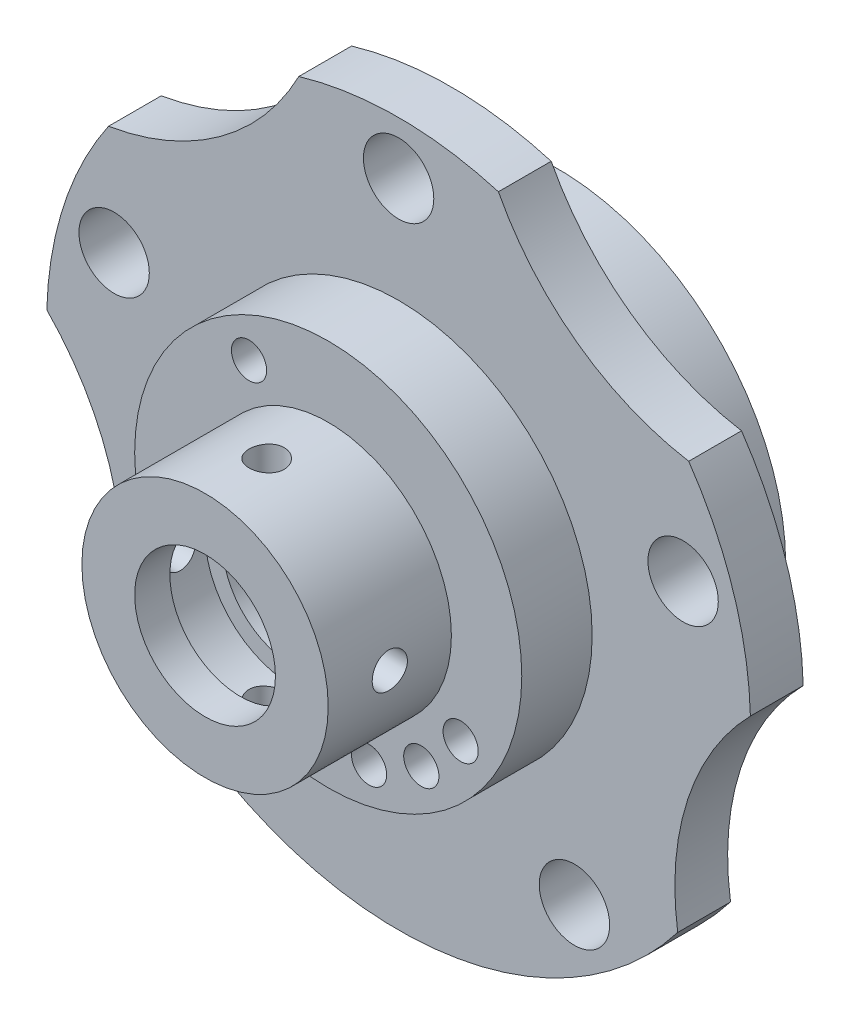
ISO-10303-21;
HEADER;
FILE_DESCRIPTION(('STEP AP214'),'2;1');
FILE_NAME('part.step','',(''),(''),'','','');
FILE_SCHEMA(('AUTOMOTIVE_DESIGN { 1 0 10303 214 1 1 1 1 }'));
ENDSEC;
DATA;
#1=APPLICATION_CONTEXT('core data for automotive mechanical design processes');
#2=APPLICATION_PROTOCOL_DEFINITION('international standard','automotive_design',2000,#1);
#3=PRODUCT_CONTEXT('',#1,'mechanical');
#4=PRODUCT('Part','Part','',(#3));
#5=PRODUCT_RELATED_PRODUCT_CATEGORY('part','',(#4));
#6=PRODUCT_DEFINITION_FORMATION('','',#4);
#7=PRODUCT_DEFINITION_CONTEXT('part definition',#1,'design');
#8=PRODUCT_DEFINITION('design','',#6,#7);
#9=PRODUCT_DEFINITION_SHAPE('','',#8);
#10=(LENGTH_UNIT() NAMED_UNIT(*) SI_UNIT(.MILLI.,.METRE.));
#11=(NAMED_UNIT(*) PLANE_ANGLE_UNIT() SI_UNIT($,.RADIAN.));
#12=(NAMED_UNIT(*) SI_UNIT($,.STERADIAN.) SOLID_ANGLE_UNIT());
#13=UNCERTAINTY_MEASURE_WITH_UNIT(LENGTH_MEASURE(1.E-05),#10,'distance_accuracy_value','');
#14=(GEOMETRIC_REPRESENTATION_CONTEXT(3) GLOBAL_UNCERTAINTY_ASSIGNED_CONTEXT((#13)) GLOBAL_UNIT_ASSIGNED_CONTEXT((#10,
#11,#12)) REPRESENTATION_CONTEXT('',''));
#15=CARTESIAN_POINT('',(0.,0.,0.));
#16=DIRECTION('',(0.,0.,1.));
#17=DIRECTION('',(1.,0.,0.));
#18=AXIS2_PLACEMENT_3D('',#15,#16,#17);
#19=CARTESIAN_POINT('',(-9.4863900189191,13.0568957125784,0.));
#20=DIRECTION('',(0.,0.,1.));
#21=DIRECTION('',(1.,0.,0.));
#22=AXIS2_PLACEMENT_3D('',#19,#20,#21);
#23=PLANE('',#22);
#24=CARTESIAN_POINT('',(-16.1679607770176,5.25328890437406,0.));
#25=DIRECTION('',(0.,0.,1.));
#26=DIRECTION('',(1.,0.,0.));
#27=AXIS2_PLACEMENT_3D('',#24,#25,#26);
#28=CIRCLE('',#27,2.);
#29=CARTESIAN_POINT('',(-14.1679607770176,5.25328890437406,0.));
#30=VERTEX_POINT('',#29);
#31=EDGE_CURVE('E655',#30,#30,#28,.T.);
#32=ORIENTED_EDGE('',*,*,#31,.T.);
#33=EDGE_LOOP('',(#32));
#34=FACE_BOUND('',#33,.T.);
#35=CARTESIAN_POINT('',(9.99234928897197,-13.7532889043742,0.));
#36=DIRECTION('',(0.,0.,1.));
#37=DIRECTION('',(1.,0.,0.));
#38=AXIS2_PLACEMENT_3D('',#35,#36,#37);
#39=CIRCLE('',#38,2.);
#40=CARTESIAN_POINT('',(11.992349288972,-13.7532889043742,0.));
#41=VERTEX_POINT('',#40);
#42=EDGE_CURVE('E666',#41,#41,#39,.T.);
#43=ORIENTED_EDGE('',*,*,#42,.T.);
#44=EDGE_LOOP('',(#43));
#45=FACE_BOUND('',#44,.T.);
#46=CARTESIAN_POINT('',(0.,0.,0.));
#47=DIRECTION('',(0.,0.,1.));
#48=DIRECTION('',(1.,0.,0.));
#49=AXIS2_PLACEMENT_3D('',#46,#47,#48);
#50=CIRCLE('',#49,20.);
#51=CARTESIAN_POINT('',(5.67218292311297,19.1787992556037,0.));
#52=VERTEX_POINT('',#51);
#53=CARTESIAN_POINT('',(-5.67218292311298,19.1787992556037,0.));
#54=VERTEX_POINT('',#53);
#55=EDGE_CURVE('E136',#52,#54,#50,.T.);
#56=ORIENTED_EDGE('',*,*,#55,.F.);
#57=CARTESIAN_POINT('',(18.9727800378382,26.1137914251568,0.));
#58=DIRECTION('',(0.,0.,-1.));
#59=DIRECTION('',(1.,0.,0.));
#60=AXIS2_PLACEMENT_3D('',#57,#58,#59);
#61=CIRCLE('',#60,15.);
#62=CARTESIAN_POINT('',(16.4873210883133,11.3211414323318,0.));
#63=VERTEX_POINT('',#62);
#64=EDGE_CURVE('E89',#63,#52,#61,.T.);
#65=ORIENTED_EDGE('',*,*,#64,.F.);
#66=CARTESIAN_POINT('',(0.,0.,0.));
#67=DIRECTION('',(0.,0.,1.));
#68=DIRECTION('',(1.,0.,0.));
#69=AXIS2_PLACEMENT_3D('',#66,#67,#68);
#70=CIRCLE('',#69,20.);
#71=CARTESIAN_POINT('',(19.9929229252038,0.53200837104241,0.));
#72=VERTEX_POINT('',#71);
#73=EDGE_CURVE('E83',#72,#63,#70,.T.);
#74=ORIENTED_EDGE('',*,*,#73,.F.);
#75=CARTESIAN_POINT('',(30.6986029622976,-9.97458074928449,0.));
#76=DIRECTION('',(0.,0.,-1.));
#77=DIRECTION('',(1.,0.,0.));
#78=AXIS2_PLACEMENT_3D('',#75,#76,#77);
#79=CIRCLE('',#78,15.);
#80=CARTESIAN_POINT('',(15.8619077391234,-12.1819490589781,0.));
#81=VERTEX_POINT('',#80);
#82=EDGE_CURVE('E126',#81,#72,#79,.T.);
#83=ORIENTED_EDGE('',*,*,#82,.F.);
#84=CARTESIAN_POINT('',(0.,0.,0.));
#85=DIRECTION('',(0.,0.,1.));
#86=DIRECTION('',(1.,0.,0.));
#87=AXIS2_PLACEMENT_3D('',#84,#85,#86);
#88=CIRCLE('',#87,20.);
#89=CARTESIAN_POINT('',(-15.8619077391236,-12.1819490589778,0.));
#90=VERTEX_POINT('',#89);
#91=EDGE_CURVE('E146',#90,#81,#88,.T.);
#92=ORIENTED_EDGE('',*,*,#91,.F.);
#93=CARTESIAN_POINT('',(-30.6986029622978,-9.97458074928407,0.));
#94=DIRECTION('',(0.,0.,-1.));
#95=DIRECTION('',(1.,0.,0.));
#96=AXIS2_PLACEMENT_3D('',#93,#94,#95);
#97=CIRCLE('',#96,15.);
#98=CARTESIAN_POINT('',(-19.9929229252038,0.532008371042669,0.));
#99=VERTEX_POINT('',#98);
#100=EDGE_CURVE('E144',#99,#90,#97,.T.);
#101=ORIENTED_EDGE('',*,*,#100,.F.);
#102=CARTESIAN_POINT('',(0.,0.,0.));
#103=DIRECTION('',(0.,0.,1.));
#104=DIRECTION('',(1.,0.,0.));
#105=AXIS2_PLACEMENT_3D('',#102,#103,#104);
#106=CIRCLE('',#105,20.);
#107=CARTESIAN_POINT('',(-16.4873210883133,11.3211414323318,0.));
#108=VERTEX_POINT('',#107);
#109=EDGE_CURVE('E142',#108,#99,#106,.T.);
#110=ORIENTED_EDGE('',*,*,#109,.F.);
#111=CARTESIAN_POINT('',(-18.9727800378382,26.1137914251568,0.));
#112=DIRECTION('',(0.,0.,-1.));
#113=DIRECTION('',(1.,0.,0.));
#114=AXIS2_PLACEMENT_3D('',#111,#112,#113);
#115=CIRCLE('',#114,15.);
#116=EDGE_CURVE('E139',#54,#108,#115,.T.);
#117=ORIENTED_EDGE('',*,*,#116,.F.);
#118=EDGE_LOOP('',(#56,#65,#74,#83,#92,#101,#110,#117));
#119=FACE_BOUND('',#118,.T.);
#120=CARTESIAN_POINT('',(16.1679607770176,5.25328890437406,0.));
#121=DIRECTION('',(0.,0.,1.));
#122=DIRECTION('',(1.,0.,0.));
#123=AXIS2_PLACEMENT_3D('',#120,#121,#122);
#124=CIRCLE('',#123,2.);
#125=CARTESIAN_POINT('',(18.1679607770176,5.25328890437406,0.));
#126=VERTEX_POINT('',#125);
#127=EDGE_CURVE('E302',#126,#126,#124,.T.);
#128=ORIENTED_EDGE('',*,*,#127,.T.);
#129=EDGE_LOOP('',(#128));
#130=FACE_BOUND('',#129,.T.);
#131=CARTESIAN_POINT('',(-9.99234928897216,-13.753288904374,0.));
#132=DIRECTION('',(0.,0.,1.));
#133=DIRECTION('',(1.,0.,0.));
#134=AXIS2_PLACEMENT_3D('',#131,#132,#133);
#135=CIRCLE('',#134,2.);
#136=CARTESIAN_POINT('',(-7.99234928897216,-13.753288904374,0.));
#137=VERTEX_POINT('',#136);
#138=EDGE_CURVE('E661',#137,#137,#135,.T.);
#139=ORIENTED_EDGE('',*,*,#138,.T.);
#140=EDGE_LOOP('',(#139));
#141=FACE_BOUND('',#140,.T.);
#142=CARTESIAN_POINT('',(0.,17.,0.));
#143=DIRECTION('',(0.,0.,1.));
#144=DIRECTION('',(1.,0.,0.));
#145=AXIS2_PLACEMENT_3D('',#142,#143,#144);
#146=CIRCLE('',#145,2.);
#147=CARTESIAN_POINT('',(2.,17.,0.));
#148=VERTEX_POINT('',#147);
#149=EDGE_CURVE('E649',#148,#148,#146,.T.);
#150=ORIENTED_EDGE('',*,*,#149,.T.);
#151=EDGE_LOOP('',(#150));
#152=FACE_BOUND('',#151,.T.);
#153=CARTESIAN_POINT('',(0.,0.,0.));
#154=DIRECTION('',(0.,0.,1.));
#155=DIRECTION('',(1.,0.,0.));
#156=AXIS2_PLACEMENT_3D('',#153,#154,#155);
#157=CIRCLE('',#156,13.);
#158=CARTESIAN_POINT('',(13.,0.,0.));
#159=VERTEX_POINT('',#158);
#160=EDGE_CURVE('E11',#159,#159,#157,.F.);
#161=ORIENTED_EDGE('',*,*,#160,.F.);
#162=EDGE_LOOP('',(#161));
#163=FACE_BOUND('',#162,.T.);
#164=ADVANCED_FACE('F31',(#34,#45,#119,#130,#141,#152,#163),#23,.F.);
#165=CARTESIAN_POINT('',(0.,0.,14.));
#166=DIRECTION('',(0.,0.,-1.));
#167=DIRECTION('',(-1.,0.,0.));
#168=AXIS2_PLACEMENT_3D('',#165,#166,#167);
#169=CYLINDRICAL_SURFACE('',#168,4.);
#170=CARTESIAN_POINT('',(0.,0.,12.));
#171=DIRECTION('',(0.,0.,1.));
#172=DIRECTION('',(1.,0.,0.));
#173=AXIS2_PLACEMENT_3D('',#170,#171,#172);
#174=CIRCLE('',#173,4.);
#175=CARTESIAN_POINT('',(4.,0.,12.));
#176=VERTEX_POINT('',#175);
#177=EDGE_CURVE('E168',#176,#176,#174,.T.);
#178=ORIENTED_EDGE('',*,*,#177,.F.);
#179=EDGE_LOOP('',(#178));
#180=FACE_BOUND('',#179,.T.);
#181=CARTESIAN_POINT('',(0.,0.,14.));
#182=DIRECTION('',(0.,0.,1.));
#183=DIRECTION('',(1.,0.,0.));
#184=AXIS2_PLACEMENT_3D('',#181,#182,#183);
#185=CIRCLE('',#184,4.);
#186=CARTESIAN_POINT('',(4.,0.,14.));
#187=VERTEX_POINT('',#186);
#188=EDGE_CURVE('E635',#187,#187,#185,.T.);
#189=ORIENTED_EDGE('',*,*,#188,.T.);
#190=EDGE_LOOP('',(#189));
#191=FACE_BOUND('',#190,.T.);
#192=ADVANCED_FACE('F255',(#180,#191),#169,.F.);
#193=CARTESIAN_POINT('',(0.,0.,7.));
#194=DIRECTION('',(0.,0.,1.));
#195=DIRECTION('',(1.,0.,0.));
#196=AXIS2_PLACEMENT_3D('',#193,#194,#195);
#197=PLANE('',#196);
#198=CARTESIAN_POINT('',(7.52585811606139,-4.93573293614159,7.));
#199=DIRECTION('',(0.,0.,1.));
#200=DIRECTION('',(1.,0.,0.));
#201=AXIS2_PLACEMENT_3D('',#198,#199,#200);
#202=CIRCLE('',#201,1.);
#203=CARTESIAN_POINT('',(8.52585811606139,-4.93573293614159,7.));
#204=VERTEX_POINT('',#203);
#205=EDGE_CURVE('E726',#204,#204,#202,.T.);
#206=ORIENTED_EDGE('',*,*,#205,.F.);
#207=EDGE_LOOP('',(#206));
#208=FACE_BOUND('',#207,.T.);
#209=CARTESIAN_POINT('',(2.3211854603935,-8.69552172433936,7.));
#210=DIRECTION('',(0.,0.,1.));
#211=DIRECTION('',(1.,0.,0.));
#212=AXIS2_PLACEMENT_3D('',#209,#210,#211);
#213=CIRCLE('',#212,1.);
#214=CARTESIAN_POINT('',(3.3211854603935,-8.69552172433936,7.));
#215=VERTEX_POINT('',#214);
#216=EDGE_CURVE('E722',#215,#215,#213,.T.);
#217=ORIENTED_EDGE('',*,*,#216,.F.);
#218=EDGE_LOOP('',(#217));
#219=FACE_BOUND('',#218,.T.);
#220=CARTESIAN_POINT('',(5.29006727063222,-7.28115294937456,7.));
#221=DIRECTION('',(0.,0.,1.));
#222=DIRECTION('',(1.,0.,0.));
#223=AXIS2_PLACEMENT_3D('',#220,#221,#222);
#224=CIRCLE('',#223,1.);
#225=CARTESIAN_POINT('',(6.29006727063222,-7.28115294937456,7.));
#226=VERTEX_POINT('',#225);
#227=EDGE_CURVE('E718',#226,#226,#224,.T.);
#228=ORIENTED_EDGE('',*,*,#227,.F.);
#229=EDGE_LOOP('',(#228));
#230=FACE_BOUND('',#229,.T.);
#231=CARTESIAN_POINT('',(-4.50000000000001,7.79422863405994,7.));
#232=DIRECTION('',(0.,0.,1.));
#233=DIRECTION('',(1.,0.,0.));
#234=AXIS2_PLACEMENT_3D('',#231,#232,#233);
#235=CIRCLE('',#234,1.);
#236=CARTESIAN_POINT('',(-3.50000000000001,7.79422863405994,7.));
#237=VERTEX_POINT('',#236);
#238=EDGE_CURVE('E714',#237,#237,#235,.T.);
#239=ORIENTED_EDGE('',*,*,#238,.F.);
#240=EDGE_LOOP('',(#239));
#241=FACE_BOUND('',#240,.T.);
#242=CARTESIAN_POINT('',(0.,0.,7.));
#243=DIRECTION('',(0.,0.,1.));
#244=DIRECTION('',(1.,0.,0.));
#245=AXIS2_PLACEMENT_3D('',#242,#243,#244);
#246=CIRCLE('',#245,11.);
#247=CARTESIAN_POINT('',(11.,0.,7.));
#248=VERTEX_POINT('',#247);
#249=EDGE_CURVE('E646',#248,#248,#246,.T.);
#250=ORIENTED_EDGE('',*,*,#249,.T.);
#251=EDGE_LOOP('',(#250));
#252=FACE_BOUND('',#251,.T.);
#253=CARTESIAN_POINT('',(0.,0.,7.));
#254=DIRECTION('',(0.,0.,1.));
#255=DIRECTION('',(1.,0.,0.));
#256=AXIS2_PLACEMENT_3D('',#253,#254,#255);
#257=CIRCLE('',#256,7.);
#258=CARTESIAN_POINT('',(7.,0.,7.));
#259=VERTEX_POINT('',#258);
#260=EDGE_CURVE('E633',#259,#259,#257,.T.);
#261=ORIENTED_EDGE('',*,*,#260,.F.);
#262=EDGE_LOOP('',(#261));
#263=FACE_BOUND('',#262,.T.);
#264=ADVANCED_FACE('F225',(#208,#219,#230,#241,#252,#263),#197,.T.);
#265=CARTESIAN_POINT('',(-9.4863900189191,13.0568957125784,3.));
#266=DIRECTION('',(0.,0.,1.));
#267=DIRECTION('',(1.,0.,0.));
#268=AXIS2_PLACEMENT_3D('',#265,#266,#267);
#269=PLANE('',#268);
#270=CARTESIAN_POINT('',(0.,17.,3.));
#271=DIRECTION('',(0.,0.,1.));
#272=DIRECTION('',(1.,0.,0.));
#273=AXIS2_PLACEMENT_3D('',#270,#271,#272);
#274=CIRCLE('',#273,2.);
#275=CARTESIAN_POINT('',(2.,17.,3.));
#276=VERTEX_POINT('',#275);
#277=EDGE_CURVE('E652',#276,#276,#274,.T.);
#278=ORIENTED_EDGE('',*,*,#277,.F.);
#279=EDGE_LOOP('',(#278));
#280=FACE_BOUND('',#279,.T.);
#281=CARTESIAN_POINT('',(-9.99234928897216,-13.753288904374,3.));
#282=DIRECTION('',(0.,0.,1.));
#283=DIRECTION('',(1.,0.,0.));
#284=AXIS2_PLACEMENT_3D('',#281,#282,#283);
#285=CIRCLE('',#284,2.);
#286=CARTESIAN_POINT('',(-7.99234928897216,-13.753288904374,3.));
#287=VERTEX_POINT('',#286);
#288=EDGE_CURVE('E663',#287,#287,#285,.T.);
#289=ORIENTED_EDGE('',*,*,#288,.F.);
#290=EDGE_LOOP('',(#289));
#291=FACE_BOUND('',#290,.T.);
#292=CARTESIAN_POINT('',(16.1679607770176,5.25328890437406,3.));
#293=DIRECTION('',(0.,0.,1.));
#294=DIRECTION('',(1.,0.,0.));
#295=AXIS2_PLACEMENT_3D('',#292,#293,#294);
#296=CIRCLE('',#295,2.);
#297=CARTESIAN_POINT('',(18.1679607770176,5.25328890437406,3.));
#298=VERTEX_POINT('',#297);
#299=EDGE_CURVE('E299',#298,#298,#296,.T.);
#300=ORIENTED_EDGE('',*,*,#299,.F.);
#301=EDGE_LOOP('',(#300));
#302=FACE_BOUND('',#301,.T.);
#303=CARTESIAN_POINT('',(0.,0.,3.));
#304=DIRECTION('',(0.,0.,1.));
#305=DIRECTION('',(1.,0.,0.));
#306=AXIS2_PLACEMENT_3D('',#303,#304,#305);
#307=CIRCLE('',#306,20.);
#308=CARTESIAN_POINT('',(5.67218292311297,19.1787992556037,3.));
#309=VERTEX_POINT('',#308);
#310=CARTESIAN_POINT('',(-5.67218292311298,19.1787992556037,3.));
#311=VERTEX_POINT('',#310);
#312=EDGE_CURVE('E151',#309,#311,#307,.T.);
#313=ORIENTED_EDGE('',*,*,#312,.T.);
#314=CARTESIAN_POINT('',(-18.9727800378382,26.1137914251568,3.));
#315=DIRECTION('',(0.,0.,-1.));
#316=DIRECTION('',(1.,0.,0.));
#317=AXIS2_PLACEMENT_3D('',#314,#315,#316);
#318=CIRCLE('',#317,15.);
#319=CARTESIAN_POINT('',(-16.4873210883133,11.3211414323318,3.));
#320=VERTEX_POINT('',#319);
#321=EDGE_CURVE('E98',#311,#320,#318,.T.);
#322=ORIENTED_EDGE('',*,*,#321,.T.);
#323=CARTESIAN_POINT('',(0.,0.,3.));
#324=DIRECTION('',(0.,0.,1.));
#325=DIRECTION('',(1.,0.,0.));
#326=AXIS2_PLACEMENT_3D('',#323,#324,#325);
#327=CIRCLE('',#326,20.);
#328=CARTESIAN_POINT('',(-19.9929229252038,0.532008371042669,3.));
#329=VERTEX_POINT('',#328);
#330=EDGE_CURVE('E308',#320,#329,#327,.T.);
#331=ORIENTED_EDGE('',*,*,#330,.T.);
#332=CARTESIAN_POINT('',(-30.6986029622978,-9.97458074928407,3.));
#333=DIRECTION('',(0.,0.,-1.));
#334=DIRECTION('',(1.,0.,0.));
#335=AXIS2_PLACEMENT_3D('',#332,#333,#334);
#336=CIRCLE('',#335,15.);
#337=CARTESIAN_POINT('',(-15.8619077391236,-12.1819490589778,3.));
#338=VERTEX_POINT('',#337);
#339=EDGE_CURVE('E310',#329,#338,#336,.T.);
#340=ORIENTED_EDGE('',*,*,#339,.T.);
#341=CARTESIAN_POINT('',(0.,0.,3.));
#342=DIRECTION('',(0.,0.,1.));
#343=DIRECTION('',(1.,0.,0.));
#344=AXIS2_PLACEMENT_3D('',#341,#342,#343);
#345=CIRCLE('',#344,20.);
#346=CARTESIAN_POINT('',(15.8619077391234,-12.1819490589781,3.));
#347=VERTEX_POINT('',#346);
#348=EDGE_CURVE('E118',#338,#347,#345,.T.);
#349=ORIENTED_EDGE('',*,*,#348,.T.);
#350=CARTESIAN_POINT('',(30.6986029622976,-9.97458074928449,3.));
#351=DIRECTION('',(0.,0.,-1.));
#352=DIRECTION('',(1.,0.,0.));
#353=AXIS2_PLACEMENT_3D('',#350,#351,#352);
#354=CIRCLE('',#353,15.);
#355=CARTESIAN_POINT('',(19.9929229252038,0.53200837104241,3.));
#356=VERTEX_POINT('',#355);
#357=EDGE_CURVE('E111',#347,#356,#354,.T.);
#358=ORIENTED_EDGE('',*,*,#357,.T.);
#359=CARTESIAN_POINT('',(0.,0.,3.));
#360=DIRECTION('',(0.,0.,1.));
#361=DIRECTION('',(1.,0.,0.));
#362=AXIS2_PLACEMENT_3D('',#359,#360,#361);
#363=CIRCLE('',#362,20.);
#364=CARTESIAN_POINT('',(16.4873210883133,11.3211414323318,3.));
#365=VERTEX_POINT('',#364);
#366=EDGE_CURVE('E116',#356,#365,#363,.T.);
#367=ORIENTED_EDGE('',*,*,#366,.T.);
#368=CARTESIAN_POINT('',(18.9727800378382,26.1137914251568,3.));
#369=DIRECTION('',(0.,0.,-1.));
#370=DIRECTION('',(1.,0.,0.));
#371=AXIS2_PLACEMENT_3D('',#368,#369,#370);
#372=CIRCLE('',#371,15.);
#373=EDGE_CURVE('E54',#365,#309,#372,.T.);
#374=ORIENTED_EDGE('',*,*,#373,.T.);
#375=EDGE_LOOP('',(#313,#322,#331,#340,#349,#358,#367,#374));
#376=FACE_BOUND('',#375,.T.);
#377=CARTESIAN_POINT('',(9.99234928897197,-13.7532889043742,3.));
#378=DIRECTION('',(0.,0.,1.));
#379=DIRECTION('',(1.,0.,0.));
#380=AXIS2_PLACEMENT_3D('',#377,#378,#379);
#381=CIRCLE('',#380,2.);
#382=CARTESIAN_POINT('',(11.992349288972,-13.7532889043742,3.));
#383=VERTEX_POINT('',#382);
#384=EDGE_CURVE('E669',#383,#383,#381,.T.);
#385=ORIENTED_EDGE('',*,*,#384,.F.);
#386=EDGE_LOOP('',(#385));
#387=FACE_BOUND('',#386,.T.);
#388=CARTESIAN_POINT('',(-16.1679607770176,5.25328890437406,3.));
#389=DIRECTION('',(0.,0.,1.));
#390=DIRECTION('',(1.,0.,0.));
#391=AXIS2_PLACEMENT_3D('',#388,#389,#390);
#392=CIRCLE('',#391,2.);
#393=CARTESIAN_POINT('',(-14.1679607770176,5.25328890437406,3.));
#394=VERTEX_POINT('',#393);
#395=EDGE_CURVE('E658',#394,#394,#392,.T.);
#396=ORIENTED_EDGE('',*,*,#395,.F.);
#397=EDGE_LOOP('',(#396));
#398=FACE_BOUND('',#397,.T.);
#399=CARTESIAN_POINT('',(0.,0.,3.));
#400=DIRECTION('',(0.,0.,1.));
#401=DIRECTION('',(1.,0.,0.));
#402=AXIS2_PLACEMENT_3D('',#399,#400,#401);
#403=CIRCLE('',#402,11.);
#404=CARTESIAN_POINT('',(11.,0.,3.));
#405=VERTEX_POINT('',#404);
#406=EDGE_CURVE('E645',#405,#405,#403,.T.);
#407=ORIENTED_EDGE('',*,*,#406,.F.);
#408=EDGE_LOOP('',(#407));
#409=FACE_BOUND('',#408,.T.);
#410=ADVANCED_FACE('F113',(#280,#291,#302,#376,#387,#398,#409),#269,.T.);
#411=CARTESIAN_POINT('',(0.,0.,0.));
#412=DIRECTION('',(0.,0.,-1.));
#413=DIRECTION('',(-1.,0.,0.));
#414=AXIS2_PLACEMENT_3D('',#411,#412,#413);
#415=CIRCLE('',#414,11.);
#416=CARTESIAN_POINT('',(-11.,0.,0.));
#417=VERTEX_POINT('',#416);
#418=EDGE_CURVE('E279',#417,#417,#415,.T.);
#419=ORIENTED_EDGE('',*,*,#418,.T.);
#420=EDGE_LOOP('',(#419));
#421=FACE_BOUND('',#420,.T.);
#422=CARTESIAN_POINT('',(7.52585811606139,-4.93573293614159,0.));
#423=DIRECTION('',(0.,0.,1.));
#424=DIRECTION('',(1.,0.,0.));
#425=AXIS2_PLACEMENT_3D('',#422,#423,#424);
#426=CIRCLE('',#425,1.);
#427=CARTESIAN_POINT('',(8.52585811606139,-4.93573293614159,0.));
#428=VERTEX_POINT('',#427);
#429=EDGE_CURVE('E283',#428,#428,#426,.T.);
#430=ORIENTED_EDGE('',*,*,#429,.T.);
#431=EDGE_LOOP('',(#430));
#432=FACE_BOUND('',#431,.T.);
#433=CARTESIAN_POINT('',(2.3211854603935,-8.69552172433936,0.));
#434=DIRECTION('',(0.,0.,1.));
#435=DIRECTION('',(1.,0.,0.));
#436=AXIS2_PLACEMENT_3D('',#433,#434,#435);
#437=CIRCLE('',#436,1.);
#438=CARTESIAN_POINT('',(3.3211854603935,-8.69552172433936,0.));
#439=VERTEX_POINT('',#438);
#440=EDGE_CURVE('E287',#439,#439,#437,.T.);
#441=ORIENTED_EDGE('',*,*,#440,.T.);
#442=EDGE_LOOP('',(#441));
#443=FACE_BOUND('',#442,.T.);
#444=CARTESIAN_POINT('',(5.29006727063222,-7.28115294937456,0.));
#445=DIRECTION('',(0.,0.,1.));
#446=DIRECTION('',(1.,0.,0.));
#447=AXIS2_PLACEMENT_3D('',#444,#445,#446);
#448=CIRCLE('',#447,1.);
#449=CARTESIAN_POINT('',(6.29006727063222,-7.28115294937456,0.));
#450=VERTEX_POINT('',#449);
#451=EDGE_CURVE('E291',#450,#450,#448,.T.);
#452=ORIENTED_EDGE('',*,*,#451,.T.);
#453=EDGE_LOOP('',(#452));
#454=FACE_BOUND('',#453,.T.);
#455=CARTESIAN_POINT('',(-4.50000000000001,7.79422863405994,0.));
#456=DIRECTION('',(0.,0.,1.));
#457=DIRECTION('',(1.,0.,0.));
#458=AXIS2_PLACEMENT_3D('',#455,#456,#457);
#459=CIRCLE('',#458,1.);
#460=CARTESIAN_POINT('',(-3.50000000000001,7.79422863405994,0.));
#461=VERTEX_POINT('',#460);
#462=EDGE_CURVE('E295',#461,#461,#459,.T.);
#463=ORIENTED_EDGE('',*,*,#462,.T.);
#464=EDGE_LOOP('',(#463));
#465=FACE_BOUND('',#464,.T.);
#466=CARTESIAN_POINT('',(0.,0.,0.));
#467=DIRECTION('',(0.,0.,1.));
#468=DIRECTION('',(1.,0.,0.));
#469=AXIS2_PLACEMENT_3D('',#466,#467,#468);
#470=CIRCLE('',#469,5.);
#471=CARTESIAN_POINT('',(5.,0.,0.));
#472=VERTEX_POINT('',#471);
#473=EDGE_CURVE('E140',#472,#472,#470,.T.);
#474=ORIENTED_EDGE('',*,*,#473,.T.);
#475=EDGE_LOOP('',(#474));
#476=FACE_BOUND('',#475,.T.);
#477=ADVANCED_FACE('F258',(#421,#432,#443,#454,#465,#476),#23,.F.);
#478=CARTESIAN_POINT('',(0.,0.,3.));
#479=DIRECTION('',(0.,0.,-1.));
#480=DIRECTION('',(-1.,0.,0.));
#481=AXIS2_PLACEMENT_3D('',#478,#479,#480);
#482=CYLINDRICAL_SURFACE('',#481,20.);
#483=ORIENTED_EDGE('',*,*,#55,.T.);
#484=DIRECTION('',(0.,0.,-1.));
#485=VECTOR('',#484,1.);
#486=CARTESIAN_POINT('',(-5.67218292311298,19.1787992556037,3.));
#487=LINE('',#486,#485);
#488=EDGE_CURVE('E45',#311,#54,#487,.T.);
#489=ORIENTED_EDGE('',*,*,#488,.F.);
#490=ORIENTED_EDGE('',*,*,#312,.F.);
#491=DIRECTION('',(0.,0.,-1.));
#492=VECTOR('',#491,1.);
#493=CARTESIAN_POINT('',(5.67218292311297,19.1787992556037,3.));
#494=LINE('',#493,#492);
#495=EDGE_CURVE('E132',#309,#52,#494,.T.);
#496=ORIENTED_EDGE('',*,*,#495,.T.);
#497=EDGE_LOOP('',(#483,#489,#490,#496));
#498=FACE_BOUND('',#497,.T.);
#499=ADVANCED_FACE('F33',(#498),#482,.T.);
#500=CARTESIAN_POINT('',(-18.9727800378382,26.1137914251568,3.));
#501=DIRECTION('',(0.,0.,-1.));
#502=DIRECTION('',(-1.,0.,0.));
#503=AXIS2_PLACEMENT_3D('',#500,#501,#502);
#504=CYLINDRICAL_SURFACE('',#503,15.);
#505=ORIENTED_EDGE('',*,*,#116,.T.);
#506=DIRECTION('',(0.,0.,-1.));
#507=VECTOR('',#506,1.);
#508=CARTESIAN_POINT('',(-16.4873210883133,11.3211414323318,3.));
#509=LINE('',#508,#507);
#510=EDGE_CURVE('E161',#320,#108,#509,.T.);
#511=ORIENTED_EDGE('',*,*,#510,.F.);
#512=ORIENTED_EDGE('',*,*,#321,.F.);
#513=ORIENTED_EDGE('',*,*,#488,.T.);
#514=EDGE_LOOP('',(#505,#511,#512,#513));
#515=FACE_BOUND('',#514,.T.);
#516=ADVANCED_FACE('F273',(#515),#504,.F.);
#517=CARTESIAN_POINT('',(0.,0.,3.));
#518=DIRECTION('',(0.,0.,-1.));
#519=DIRECTION('',(-1.,0.,0.));
#520=AXIS2_PLACEMENT_3D('',#517,#518,#519);
#521=CYLINDRICAL_SURFACE('',#520,20.);
#522=ORIENTED_EDGE('',*,*,#109,.T.);
#523=DIRECTION('',(0.,0.,-1.));
#524=VECTOR('',#523,1.);
#525=CARTESIAN_POINT('',(-19.9929229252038,0.532008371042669,3.));
#526=LINE('',#525,#524);
#527=EDGE_CURVE('E158',#329,#99,#526,.T.);
#528=ORIENTED_EDGE('',*,*,#527,.F.);
#529=ORIENTED_EDGE('',*,*,#330,.F.);
#530=ORIENTED_EDGE('',*,*,#510,.T.);
#531=EDGE_LOOP('',(#522,#528,#529,#530));
#532=FACE_BOUND('',#531,.T.);
#533=ADVANCED_FACE('F344',(#532),#521,.T.);
#534=CARTESIAN_POINT('',(-30.6986029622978,-9.97458074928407,3.));
#535=DIRECTION('',(0.,0.,-1.));
#536=DIRECTION('',(-1.,0.,0.));
#537=AXIS2_PLACEMENT_3D('',#534,#535,#536);
#538=CYLINDRICAL_SURFACE('',#537,15.);
#539=ORIENTED_EDGE('',*,*,#100,.T.);
#540=DIRECTION('',(0.,0.,-1.));
#541=VECTOR('',#540,1.);
#542=CARTESIAN_POINT('',(-15.8619077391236,-12.1819490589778,3.));
#543=LINE('',#542,#541);
#544=EDGE_CURVE('E155',#338,#90,#543,.T.);
#545=ORIENTED_EDGE('',*,*,#544,.F.);
#546=ORIENTED_EDGE('',*,*,#339,.F.);
#547=ORIENTED_EDGE('',*,*,#527,.T.);
#548=EDGE_LOOP('',(#539,#545,#546,#547));
#549=FACE_BOUND('',#548,.T.);
#550=ADVANCED_FACE('F316',(#549),#538,.F.);
#551=CARTESIAN_POINT('',(0.,0.,3.));
#552=DIRECTION('',(0.,0.,-1.));
#553=DIRECTION('',(-1.,0.,0.));
#554=AXIS2_PLACEMENT_3D('',#551,#552,#553);
#555=CYLINDRICAL_SURFACE('',#554,20.);
#556=ORIENTED_EDGE('',*,*,#91,.T.);
#557=DIRECTION('',(0.,0.,-1.));
#558=VECTOR('',#557,1.);
#559=CARTESIAN_POINT('',(15.8619077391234,-12.1819490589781,3.));
#560=LINE('',#559,#558);
#561=EDGE_CURVE('E127',#347,#81,#560,.T.);
#562=ORIENTED_EDGE('',*,*,#561,.F.);
#563=ORIENTED_EDGE('',*,*,#348,.F.);
#564=ORIENTED_EDGE('',*,*,#544,.T.);
#565=EDGE_LOOP('',(#556,#562,#563,#564));
#566=FACE_BOUND('',#565,.T.);
#567=ADVANCED_FACE('F320',(#566),#555,.T.);
#568=CARTESIAN_POINT('',(30.6986029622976,-9.97458074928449,3.));
#569=DIRECTION('',(0.,0.,-1.));
#570=DIRECTION('',(-1.,0.,0.));
#571=AXIS2_PLACEMENT_3D('',#568,#569,#570);
#572=CYLINDRICAL_SURFACE('',#571,15.);
#573=ORIENTED_EDGE('',*,*,#82,.T.);
#574=DIRECTION('',(0.,0.,-1.));
#575=VECTOR('',#574,1.);
#576=CARTESIAN_POINT('',(19.9929229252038,0.53200837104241,3.));
#577=LINE('',#576,#575);
#578=EDGE_CURVE('E123',#356,#72,#577,.T.);
#579=ORIENTED_EDGE('',*,*,#578,.F.);
#580=ORIENTED_EDGE('',*,*,#357,.F.);
#581=ORIENTED_EDGE('',*,*,#561,.T.);
#582=EDGE_LOOP('',(#573,#579,#580,#581));
#583=FACE_BOUND('',#582,.T.);
#584=ADVANCED_FACE('F124',(#583),#572,.F.);
#585=CARTESIAN_POINT('',(0.,0.,3.));
#586=DIRECTION('',(0.,0.,-1.));
#587=DIRECTION('',(-1.,0.,0.));
#588=AXIS2_PLACEMENT_3D('',#585,#586,#587);
#589=CYLINDRICAL_SURFACE('',#588,20.);
#590=ORIENTED_EDGE('',*,*,#73,.T.);
#591=DIRECTION('',(0.,0.,-1.));
#592=VECTOR('',#591,1.);
#593=CARTESIAN_POINT('',(16.4873210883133,11.3211414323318,3.));
#594=LINE('',#593,#592);
#595=EDGE_CURVE('E128',#365,#63,#594,.T.);
#596=ORIENTED_EDGE('',*,*,#595,.F.);
#597=ORIENTED_EDGE('',*,*,#366,.F.);
#598=ORIENTED_EDGE('',*,*,#578,.T.);
#599=EDGE_LOOP('',(#590,#596,#597,#598));
#600=FACE_BOUND('',#599,.T.);
#601=ADVANCED_FACE('F130',(#600),#589,.T.);
#602=CARTESIAN_POINT('',(18.9727800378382,26.1137914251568,3.));
#603=DIRECTION('',(0.,0.,-1.));
#604=DIRECTION('',(-1.,0.,0.));
#605=AXIS2_PLACEMENT_3D('',#602,#603,#604);
#606=CYLINDRICAL_SURFACE('',#605,15.);
#607=ORIENTED_EDGE('',*,*,#64,.T.);
#608=ORIENTED_EDGE('',*,*,#495,.F.);
#609=ORIENTED_EDGE('',*,*,#373,.F.);
#610=ORIENTED_EDGE('',*,*,#595,.T.);
#611=EDGE_LOOP('',(#607,#608,#609,#610));
#612=FACE_BOUND('',#611,.T.);
#613=ADVANCED_FACE('F327',(#612),#606,.F.);
#614=CARTESIAN_POINT('',(0.,0.,3.));
#615=DIRECTION('',(0.,0.,-1.));
#616=DIRECTION('',(-1.,0.,0.));
#617=AXIS2_PLACEMENT_3D('',#614,#615,#616);
#618=CYLINDRICAL_SURFACE('',#617,5.);
#619=ORIENTED_EDGE('',*,*,#473,.F.);
#620=EDGE_LOOP('',(#619));
#621=FACE_BOUND('',#620,.T.);
#622=CARTESIAN_POINT('',(0.,0.,7.));
#623=DIRECTION('',(0.,0.,1.));
#624=DIRECTION('',(1.,0.,0.));
#625=AXIS2_PLACEMENT_3D('',#622,#623,#624);
#626=CIRCLE('',#625,5.);
#627=CARTESIAN_POINT('',(5.,0.,7.));
#628=VERTEX_POINT('',#627);
#629=EDGE_CURVE('E637',#628,#628,#626,.T.);
#630=ORIENTED_EDGE('',*,*,#629,.T.);
#631=EDGE_LOOP('',(#630));
#632=FACE_BOUND('',#631,.T.);
#633=ADVANCED_FACE('F329',(#621,#632),#618,.F.);
#634=CARTESIAN_POINT('',(16.1679607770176,5.25328890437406,3.));
#635=DIRECTION('',(0.,0.,-1.));
#636=DIRECTION('',(-1.,0.,0.));
#637=AXIS2_PLACEMENT_3D('',#634,#635,#636);
#638=CYLINDRICAL_SURFACE('',#637,2.);
#639=ORIENTED_EDGE('',*,*,#299,.T.);
#640=EDGE_LOOP('',(#639));
#641=FACE_BOUND('',#640,.T.);
#642=ORIENTED_EDGE('',*,*,#127,.F.);
#643=EDGE_LOOP('',(#642));
#644=FACE_BOUND('',#643,.T.);
#645=ADVANCED_FACE('F334',(#641,#644),#638,.F.);
#646=CARTESIAN_POINT('',(9.99234928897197,-13.7532889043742,3.));
#647=DIRECTION('',(0.,0.,-1.));
#648=DIRECTION('',(-1.,0.,0.));
#649=AXIS2_PLACEMENT_3D('',#646,#647,#648);
#650=CYLINDRICAL_SURFACE('',#649,2.);
#651=ORIENTED_EDGE('',*,*,#384,.T.);
#652=EDGE_LOOP('',(#651));
#653=FACE_BOUND('',#652,.T.);
#654=ORIENTED_EDGE('',*,*,#42,.F.);
#655=EDGE_LOOP('',(#654));
#656=FACE_BOUND('',#655,.T.);
#657=ADVANCED_FACE('F386',(#653,#656),#650,.F.);
#658=CARTESIAN_POINT('',(-9.99234928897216,-13.753288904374,3.));
#659=DIRECTION('',(0.,0.,-1.));
#660=DIRECTION('',(-1.,0.,0.));
#661=AXIS2_PLACEMENT_3D('',#658,#659,#660);
#662=CYLINDRICAL_SURFACE('',#661,2.);
#663=ORIENTED_EDGE('',*,*,#288,.T.);
#664=EDGE_LOOP('',(#663));
#665=FACE_BOUND('',#664,.T.);
#666=ORIENTED_EDGE('',*,*,#138,.F.);
#667=EDGE_LOOP('',(#666));
#668=FACE_BOUND('',#667,.T.);
#669=ADVANCED_FACE('F396',(#665,#668),#662,.F.);
#670=CARTESIAN_POINT('',(-16.1679607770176,5.25328890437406,3.));
#671=DIRECTION('',(0.,0.,-1.));
#672=DIRECTION('',(-1.,0.,0.));
#673=AXIS2_PLACEMENT_3D('',#670,#671,#672);
#674=CYLINDRICAL_SURFACE('',#673,2.);
#675=ORIENTED_EDGE('',*,*,#395,.T.);
#676=EDGE_LOOP('',(#675));
#677=FACE_BOUND('',#676,.T.);
#678=ORIENTED_EDGE('',*,*,#31,.F.);
#679=EDGE_LOOP('',(#678));
#680=FACE_BOUND('',#679,.T.);
#681=ADVANCED_FACE('F406',(#677,#680),#674,.F.);
#682=CARTESIAN_POINT('',(0.,17.,3.));
#683=DIRECTION('',(0.,0.,-1.));
#684=DIRECTION('',(-1.,0.,0.));
#685=AXIS2_PLACEMENT_3D('',#682,#683,#684);
#686=CYLINDRICAL_SURFACE('',#685,2.);
#687=ORIENTED_EDGE('',*,*,#277,.T.);
#688=EDGE_LOOP('',(#687));
#689=FACE_BOUND('',#688,.T.);
#690=ORIENTED_EDGE('',*,*,#149,.F.);
#691=EDGE_LOOP('',(#690));
#692=FACE_BOUND('',#691,.T.);
#693=ADVANCED_FACE('F416',(#689,#692),#686,.F.);
#694=CARTESIAN_POINT('',(0.,0.,7.));
#695=DIRECTION('',(0.,0.,-1.));
#696=DIRECTION('',(-1.,0.,0.));
#697=AXIS2_PLACEMENT_3D('',#694,#695,#696);
#698=CYLINDRICAL_SURFACE('',#697,11.);
#699=ORIENTED_EDGE('',*,*,#249,.F.);
#700=EDGE_LOOP('',(#699));
#701=FACE_BOUND('',#700,.T.);
#702=ORIENTED_EDGE('',*,*,#406,.T.);
#703=EDGE_LOOP('',(#702));
#704=FACE_BOUND('',#703,.T.);
#705=ADVANCED_FACE('F426',(#701,#704),#698,.T.);
#706=CARTESIAN_POINT('',(0.,0.,14.));
#707=DIRECTION('',(0.,0.,1.));
#708=DIRECTION('',(1.,0.,0.));
#709=AXIS2_PLACEMENT_3D('',#706,#707,#708);
#710=PLANE('',#709);
#711=CARTESIAN_POINT('',(0.,0.,14.));
#712=DIRECTION('',(0.,0.,1.));
#713=DIRECTION('',(1.,0.,0.));
#714=AXIS2_PLACEMENT_3D('',#711,#712,#713);
#715=CIRCLE('',#714,7.);
#716=CARTESIAN_POINT('',(7.,0.,14.));
#717=VERTEX_POINT('',#716);
#718=EDGE_CURVE('E630',#717,#717,#715,.T.);
#719=ORIENTED_EDGE('',*,*,#718,.T.);
#720=EDGE_LOOP('',(#719));
#721=FACE_BOUND('',#720,.T.);
#722=ORIENTED_EDGE('',*,*,#188,.F.);
#723=EDGE_LOOP('',(#722));
#724=FACE_BOUND('',#723,.T.);
#725=ADVANCED_FACE('F449',(#721,#724),#710,.T.);
#726=CARTESIAN_POINT('',(0.,0.,7.));
#727=DIRECTION('',(0.,0.,1.));
#728=DIRECTION('',(1.,0.,0.));
#729=AXIS2_PLACEMENT_3D('',#726,#727,#728);
#730=PLANE('',#729);
#731=ORIENTED_EDGE('',*,*,#629,.F.);
#732=EDGE_LOOP('',(#731));
#733=FACE_BOUND('',#732,.T.);
#734=CARTESIAN_POINT('',(0.,0.,7.));
#735=DIRECTION('',(0.,0.,1.));
#736=DIRECTION('',(1.,0.,0.));
#737=AXIS2_PLACEMENT_3D('',#734,#735,#736);
#738=CIRCLE('',#737,4.);
#739=CARTESIAN_POINT('',(4.,0.,7.));
#740=VERTEX_POINT('',#739);
#741=EDGE_CURVE('E171',#740,#740,#738,.T.);
#742=ORIENTED_EDGE('',*,*,#741,.T.);
#743=EDGE_LOOP('',(#742));
#744=FACE_BOUND('',#743,.T.);
#745=ADVANCED_FACE('F222',(#733,#744),#730,.F.);
#746=CARTESIAN_POINT('',(0.,0.,14.));
#747=DIRECTION('',(0.,0.,-1.));
#748=DIRECTION('',(-1.,0.,0.));
#749=AXIS2_PLACEMENT_3D('',#746,#747,#748);
#750=CYLINDRICAL_SURFACE('',#749,7.);
#751=CARTESIAN_POINT('',(0.,-7.,11.5));
#752=CARTESIAN_POINT('',(0.055865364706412,-6.99999913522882,11.4999976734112));
#753=CARTESIAN_POINT('',(0.111763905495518,-6.99932420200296,11.4953027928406));
#754=CARTESIAN_POINT('',(0.222000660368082,-6.99669670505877,11.476650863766));
#755=CARTESIAN_POINT('',(0.27633726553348,-6.99474286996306,11.4626845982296));
#756=CARTESIAN_POINT('',(0.381838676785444,-6.98977730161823,11.4259139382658));
#757=CARTESIAN_POINT('',(0.433005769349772,-6.98676634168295,11.4031160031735));
#758=CARTESIAN_POINT('',(0.530779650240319,-6.98001989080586,11.3493444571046));
#759=CARTESIAN_POINT('',(0.577387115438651,-6.97628450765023,11.3183720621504));
#760=CARTESIAN_POINT('',(0.665058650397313,-6.96847539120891,11.2488958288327));
#761=CARTESIAN_POINT('',(0.706085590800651,-6.96439965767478,11.2103453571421));
#762=CARTESIAN_POINT('',(0.781111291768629,-6.95638499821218,11.1269075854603));
#763=CARTESIAN_POINT('',(0.815109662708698,-6.95244607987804,11.0820199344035));
#764=CARTESIAN_POINT('',(0.87525587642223,-6.94513156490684,10.9869348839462));
#765=CARTESIAN_POINT('',(0.901368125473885,-6.94175855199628,10.9367147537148));
#766=CARTESIAN_POINT('',(0.9447734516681,-6.93598482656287,10.8325454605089));
#767=CARTESIAN_POINT('',(0.962066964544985,-6.93358406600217,10.7785964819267));
#768=CARTESIAN_POINT('',(0.987229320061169,-6.93004619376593,10.668889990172));
#769=CARTESIAN_POINT('',(0.995161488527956,-6.92890059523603,10.6131472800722));
#770=CARTESIAN_POINT('',(1.00157210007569,-6.92797693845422,10.5011110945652));
#771=CARTESIAN_POINT('',(1.00005103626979,-6.92819880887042,10.4448176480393));
#772=CARTESIAN_POINT('',(0.987650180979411,-6.9299772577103,10.3337234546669));
#773=CARTESIAN_POINT('',(0.976840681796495,-6.9315238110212,10.2789146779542));
#774=CARTESIAN_POINT('',(0.946279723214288,-6.93576171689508,10.1718969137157));
#775=CARTESIAN_POINT('',(0.926528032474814,-6.9384530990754,10.1196879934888));
#776=CARTESIAN_POINT('',(0.878569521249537,-6.94468857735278,10.0191367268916));
#777=CARTESIAN_POINT('',(0.850332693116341,-6.94823569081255,9.9708088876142));
#778=CARTESIAN_POINT('',(0.786226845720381,-6.95578073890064,9.8795507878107));
#779=CARTESIAN_POINT('',(0.750357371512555,-6.95977870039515,9.83662084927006));
#780=CARTESIAN_POINT('',(0.671617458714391,-6.9678193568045,9.75696959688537));
#781=CARTESIAN_POINT('',(0.628686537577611,-6.97186212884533,9.72030805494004));
#782=CARTESIAN_POINT('',(0.537249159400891,-6.97950317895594,9.65470149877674));
#783=CARTESIAN_POINT('',(0.488742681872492,-6.98310145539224,9.62575651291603));
#784=CARTESIAN_POINT('',(0.387481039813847,-6.98945135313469,9.57640256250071));
#785=CARTESIAN_POINT('',(0.334723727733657,-6.99220254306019,9.55599794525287));
#786=CARTESIAN_POINT('',(0.226483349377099,-6.99654459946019,9.52435453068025));
#787=CARTESIAN_POINT('',(0.171000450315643,-6.99813553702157,9.51311517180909));
#788=CARTESIAN_POINT('',(0.0594000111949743,-6.99996847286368,9.50020018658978));
#789=CARTESIAN_POINT('',(0.00329216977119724,-7.00022206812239,9.49844233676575));
#790=CARTESIAN_POINT('',(-0.108417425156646,-6.9993832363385,9.50432240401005));
#791=CARTESIAN_POINT('',(-0.164019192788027,-6.99829084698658,9.51196005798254));
#792=CARTESIAN_POINT('',(-0.272891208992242,-6.99488996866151,9.53634597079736));
#793=CARTESIAN_POINT('',(-0.326170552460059,-6.99258679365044,9.55305442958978));
#794=CARTESIAN_POINT('',(-0.429171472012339,-6.98702187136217,9.59506586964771));
#795=CARTESIAN_POINT('',(-0.478892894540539,-6.98376008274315,9.62036922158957));
#796=CARTESIAN_POINT('',(-0.573729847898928,-6.97661188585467,9.67904690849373));
#797=CARTESIAN_POINT('',(-0.618812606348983,-6.97272147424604,9.71247371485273));
#798=CARTESIAN_POINT('',(-0.702757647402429,-6.96476223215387,9.78637603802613));
#799=CARTESIAN_POINT('',(-0.74161960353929,-6.96069339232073,9.82685192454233));
#800=CARTESIAN_POINT('',(-0.812316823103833,-6.95279940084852,9.91406835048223));
#801=CARTESIAN_POINT('',(-0.844097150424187,-6.94897630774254,9.96085363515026));
#802=CARTESIAN_POINT('',(-0.899347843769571,-6.94204235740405,10.059146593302));
#803=CARTESIAN_POINT('',(-0.922818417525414,-6.9389314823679,10.1106541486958));
#804=CARTESIAN_POINT('',(-0.960697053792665,-6.93378885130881,10.2167616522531));
#805=CARTESIAN_POINT('',(-0.975134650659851,-6.93175358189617,10.2713508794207));
#806=CARTESIAN_POINT('',(-0.994631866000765,-6.92898304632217,10.3822102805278));
#807=CARTESIAN_POINT('',(-0.999692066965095,-6.92824769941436,10.4384803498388));
#808=CARTESIAN_POINT('',(-1.00027795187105,-6.92816308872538,10.5505569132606));
#809=CARTESIAN_POINT('',(-0.99588998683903,-6.92880127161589,10.6063629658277));
#810=CARTESIAN_POINT('',(-0.977888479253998,-6.9313646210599,10.7164350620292));
#811=CARTESIAN_POINT('',(-0.964274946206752,-6.93328978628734,10.7707011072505));
#812=CARTESIAN_POINT('',(-0.928238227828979,-6.93820594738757,10.8761326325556));
#813=CARTESIAN_POINT('',(-0.905820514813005,-6.94119628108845,10.9273000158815));
#814=CARTESIAN_POINT('',(-0.852820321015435,-6.94790672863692,11.0251612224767));
#815=CARTESIAN_POINT('',(-0.822237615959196,-6.95162686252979,11.0718549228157));
#816=CARTESIAN_POINT('',(-0.753459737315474,-6.95941831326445,11.1598829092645));
#817=CARTESIAN_POINT('',(-0.715200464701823,-6.96349241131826,11.2011668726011));
#818=CARTESIAN_POINT('',(-0.632290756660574,-6.97150911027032,11.2767598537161));
#819=CARTESIAN_POINT('',(-0.58763883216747,-6.97545168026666,11.3110672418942));
#820=CARTESIAN_POINT('',(-0.492951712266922,-6.98278331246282,11.3718837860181));
#821=CARTESIAN_POINT('',(-0.442890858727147,-6.98616952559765,11.3983533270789));
#822=CARTESIAN_POINT('',(-0.339010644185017,-6.99197878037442,11.4424698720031));
#823=CARTESIAN_POINT('',(-0.285195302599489,-6.99440283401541,11.4601261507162));
#824=CARTESIAN_POINT('',(-0.192605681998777,-6.99745181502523,11.4820417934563));
#825=CARTESIAN_POINT('',(-0.154406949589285,-6.99840255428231,11.4887660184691));
#826=CARTESIAN_POINT('',(-0.0774774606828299,-6.99967694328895,11.4977459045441));
#827=CARTESIAN_POINT('',(-0.0387467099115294,-7.00000059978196,11.5000016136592));
#828=CARTESIAN_POINT('',(0.,-7.,11.5));
#829=B_SPLINE_CURVE_WITH_KNOTS('',3,(#751,#752,#753,#754,#755,#756,#757,#758,#759,#760,#761,
#762,#763,#764,#765,#766,#767,#768,#769,#770,#771,#772,#773,#774,#775,#776,#777,#778,#779,#780,
#781,#782,#783,#784,#785,#786,#787,#788,#789,#790,#791,#792,#793,#794,#795,#796,#797,#798,#799,
#800,#801,#802,#803,#804,#805,#806,#807,#808,#809,#810,#811,#812,#813,#814,#815,#816,#817,#818,
#819,#820,#821,#822,#823,#824,#825,#826,#827,#828),.UNSPECIFIED.,.T.,.F.,(4,2,2,2,2,2,2,2,2,2,2,
2,2,2,2,2,2,2,2,2,2,2,2,2,2,2,2,2,2,2,2,2,2,2,2,2,2,2,4),(0.,0.167454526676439,
0.335075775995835,0.502574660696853,0.67004864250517,0.838587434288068,1.00713556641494,
1.17643344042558,1.34572294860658,1.51386059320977,1.68198946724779,1.84885708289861,
2.01572901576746,2.1831981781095,2.35067732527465,2.51967378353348,2.6886708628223,
2.85775386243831,3.02682650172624,3.19443056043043,3.3620299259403,3.5288997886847,
3.69577684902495,3.86376187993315,4.03175572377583,4.20101062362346,4.37026129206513,
4.53895564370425,4.70763951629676,4.87478825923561,5.0419368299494,5.20898167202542,
5.37603110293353,5.54453823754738,5.71308468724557,5.88246902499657,6.05167472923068,
6.16781792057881,6.28395986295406),.UNSPECIFIED.);
#830=CARTESIAN_POINT('',(0.,-7.,11.5));
#831=VERTEX_POINT('',#830);
#832=EDGE_CURVE('E180',#831,#831,#829,.T.);
#833=ORIENTED_EDGE('',*,*,#832,.T.);
#834=EDGE_LOOP('',(#833));
#835=FACE_BOUND('',#834,.T.);
#836=CARTESIAN_POINT('',(0.,7.,11.5));
#837=CARTESIAN_POINT('',(-0.0558653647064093,6.99999913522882,11.4999976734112));
#838=CARTESIAN_POINT('',(-0.111763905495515,6.99932420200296,11.4953027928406));
#839=CARTESIAN_POINT('',(-0.22200066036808,6.99669670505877,11.476650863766));
#840=CARTESIAN_POINT('',(-0.276337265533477,6.99474286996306,11.4626845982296));
#841=CARTESIAN_POINT('',(-0.381838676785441,6.98977730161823,11.4259139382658));
#842=CARTESIAN_POINT('',(-0.433005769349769,6.98676634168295,11.4031160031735));
#843=CARTESIAN_POINT('',(-0.530779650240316,6.98001989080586,11.3493444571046));
#844=CARTESIAN_POINT('',(-0.577387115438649,6.97628450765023,11.3183720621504));
#845=CARTESIAN_POINT('',(-0.665058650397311,6.96847539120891,11.2488958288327));
#846=CARTESIAN_POINT('',(-0.70608559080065,6.96439965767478,11.2103453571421));
#847=CARTESIAN_POINT('',(-0.781111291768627,6.95638499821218,11.1269075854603));
#848=CARTESIAN_POINT('',(-0.815109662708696,6.95244607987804,11.0820199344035));
#849=CARTESIAN_POINT('',(-0.875255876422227,6.94513156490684,10.9869348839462));
#850=CARTESIAN_POINT('',(-0.901368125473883,6.94175855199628,10.9367147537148));
#851=CARTESIAN_POINT('',(-0.944773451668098,6.93598482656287,10.8325454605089));
#852=CARTESIAN_POINT('',(-0.962066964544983,6.93358406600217,10.7785964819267));
#853=CARTESIAN_POINT('',(-0.987229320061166,6.93004619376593,10.668889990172));
#854=CARTESIAN_POINT('',(-0.995161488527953,6.92890059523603,10.6131472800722));
#855=CARTESIAN_POINT('',(-1.00157210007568,6.92797693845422,10.5011110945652));
#856=CARTESIAN_POINT('',(-1.00005103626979,6.92819880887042,10.4448176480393));
#857=CARTESIAN_POINT('',(-0.987650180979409,6.9299772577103,10.3337234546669));
#858=CARTESIAN_POINT('',(-0.976840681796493,6.9315238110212,10.2789146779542));
#859=CARTESIAN_POINT('',(-0.946279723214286,6.93576171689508,10.1718969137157));
#860=CARTESIAN_POINT('',(-0.926528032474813,6.9384530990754,10.1196879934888));
#861=CARTESIAN_POINT('',(-0.878569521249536,6.94468857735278,10.0191367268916));
#862=CARTESIAN_POINT('',(-0.850332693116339,6.94823569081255,9.9708088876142));
#863=CARTESIAN_POINT('',(-0.786226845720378,6.95578073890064,9.8795507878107));
#864=CARTESIAN_POINT('',(-0.750357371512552,6.95977870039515,9.83662084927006));
#865=CARTESIAN_POINT('',(-0.671617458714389,6.9678193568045,9.75696959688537));
#866=CARTESIAN_POINT('',(-0.628686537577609,6.97186212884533,9.72030805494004));
#867=CARTESIAN_POINT('',(-0.537249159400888,6.97950317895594,9.65470149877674));
#868=CARTESIAN_POINT('',(-0.488742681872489,6.98310145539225,9.62575651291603));
#869=CARTESIAN_POINT('',(-0.387481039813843,6.98945135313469,9.57640256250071));
#870=CARTESIAN_POINT('',(-0.334723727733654,6.99220254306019,9.55599794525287));
#871=CARTESIAN_POINT('',(-0.226483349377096,6.99654459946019,9.52435453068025));
#872=CARTESIAN_POINT('',(-0.17100045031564,6.99813553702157,9.51311517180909));
#873=CARTESIAN_POINT('',(-0.0594000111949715,6.99996847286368,9.50020018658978));
#874=CARTESIAN_POINT('',(-0.0032921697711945,7.00022206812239,9.49844233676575));
#875=CARTESIAN_POINT('',(0.108417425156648,6.9993832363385,9.50432240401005));
#876=CARTESIAN_POINT('',(0.16401919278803,6.99829084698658,9.51196005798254));
#877=CARTESIAN_POINT('',(0.272891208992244,6.99488996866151,9.53634597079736));
#878=CARTESIAN_POINT('',(0.326170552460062,6.99258679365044,9.55305442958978));
#879=CARTESIAN_POINT('',(0.429171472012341,6.98702187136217,9.59506586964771));
#880=CARTESIAN_POINT('',(0.478892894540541,6.98376008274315,9.62036922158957));
#881=CARTESIAN_POINT('',(0.573729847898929,6.97661188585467,9.67904690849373));
#882=CARTESIAN_POINT('',(0.618812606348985,6.97272147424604,9.71247371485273));
#883=CARTESIAN_POINT('',(0.702757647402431,6.96476223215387,9.78637603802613));
#884=CARTESIAN_POINT('',(0.741619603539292,6.96069339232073,9.82685192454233));
#885=CARTESIAN_POINT('',(0.812316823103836,6.95279940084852,9.91406835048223));
#886=CARTESIAN_POINT('',(0.84409715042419,6.94897630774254,9.96085363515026));
#887=CARTESIAN_POINT('',(0.899347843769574,6.94204235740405,10.059146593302));
#888=CARTESIAN_POINT('',(0.922818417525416,6.93893148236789,10.1106541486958));
#889=CARTESIAN_POINT('',(0.960697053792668,6.9337888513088,10.2167616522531));
#890=CARTESIAN_POINT('',(0.975134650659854,6.93175358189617,10.2713508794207));
#891=CARTESIAN_POINT('',(0.994631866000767,6.92898304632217,10.3822102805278));
#892=CARTESIAN_POINT('',(0.999692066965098,6.92824769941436,10.4384803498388));
#893=CARTESIAN_POINT('',(1.00027795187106,6.92816308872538,10.5505569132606));
#894=CARTESIAN_POINT('',(0.995889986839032,6.92880127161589,10.6063629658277));
#895=CARTESIAN_POINT('',(0.977888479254,6.9313646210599,10.7164350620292));
#896=CARTESIAN_POINT('',(0.964274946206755,6.93328978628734,10.7707011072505));
#897=CARTESIAN_POINT('',(0.928238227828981,6.93820594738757,10.8761326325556));
#898=CARTESIAN_POINT('',(0.905820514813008,6.94119628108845,10.9273000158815));
#899=CARTESIAN_POINT('',(0.852820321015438,6.94790672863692,11.0251612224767));
#900=CARTESIAN_POINT('',(0.822237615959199,6.95162686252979,11.0718549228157));
#901=CARTESIAN_POINT('',(0.753459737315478,6.95941831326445,11.1598829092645));
#902=CARTESIAN_POINT('',(0.715200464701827,6.96349241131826,11.2011668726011));
#903=CARTESIAN_POINT('',(0.632290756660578,6.97150911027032,11.2767598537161));
#904=CARTESIAN_POINT('',(0.587638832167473,6.97545168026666,11.3110672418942));
#905=CARTESIAN_POINT('',(0.492951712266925,6.98278331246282,11.3718837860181));
#906=CARTESIAN_POINT('',(0.44289085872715,6.98616952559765,11.3983533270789));
#907=CARTESIAN_POINT('',(0.339010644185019,6.99197878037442,11.4424698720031));
#908=CARTESIAN_POINT('',(0.285195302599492,6.99440283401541,11.4601261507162));
#909=CARTESIAN_POINT('',(0.19260568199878,6.99745181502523,11.4820417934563));
#910=CARTESIAN_POINT('',(0.154406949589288,6.99840255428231,11.4887660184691));
#911=CARTESIAN_POINT('',(0.0774774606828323,6.99967694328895,11.4977459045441));
#912=CARTESIAN_POINT('',(0.0387467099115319,7.00000059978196,11.5000016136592));
#913=CARTESIAN_POINT('',(0.,7.,11.5));
#914=B_SPLINE_CURVE_WITH_KNOTS('',3,(#836,#837,#838,#839,#840,#841,#842,#843,#844,#845,#846,
#847,#848,#849,#850,#851,#852,#853,#854,#855,#856,#857,#858,#859,#860,#861,#862,#863,#864,#865,
#866,#867,#868,#869,#870,#871,#872,#873,#874,#875,#876,#877,#878,#879,#880,#881,#882,#883,#884,
#885,#886,#887,#888,#889,#890,#891,#892,#893,#894,#895,#896,#897,#898,#899,#900,#901,#902,#903,
#904,#905,#906,#907,#908,#909,#910,#911,#912,#913),.UNSPECIFIED.,.T.,.F.,(4,2,2,2,2,2,2,2,2,2,2,
2,2,2,2,2,2,2,2,2,2,2,2,2,2,2,2,2,2,2,2,2,2,2,2,2,2,2,4),(0.,0.167454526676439,
0.335075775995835,0.502574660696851,0.670048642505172,0.838587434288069,1.00713556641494,
1.17643344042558,1.34572294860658,1.51386059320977,1.68198946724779,1.84885708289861,
2.01572901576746,2.1831981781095,2.35067732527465,2.51967378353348,2.6886708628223,
2.85775386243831,3.02682650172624,3.19443056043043,3.3620299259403,3.5288997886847,
3.69577684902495,3.86376187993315,4.03175572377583,4.20101062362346,4.37026129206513,
4.53895564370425,4.70763951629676,4.87478825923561,5.0419368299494,5.20898167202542,
5.37603110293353,5.54453823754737,5.71308468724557,5.88246902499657,6.05167472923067,
6.16781792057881,6.28395986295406),.UNSPECIFIED.);
#915=CARTESIAN_POINT('',(0.,7.,11.5));
#916=VERTEX_POINT('',#915);
#917=EDGE_CURVE('E230',#916,#916,#914,.T.);
#918=ORIENTED_EDGE('',*,*,#917,.T.);
#919=EDGE_LOOP('',(#918));
#920=FACE_BOUND('',#919,.T.);
#921=CARTESIAN_POINT('',(-7.,0.,11.5));
#922=CARTESIAN_POINT('',(-6.99999913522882,-0.0558653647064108,11.4999976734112));
#923=CARTESIAN_POINT('',(-6.99932420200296,-0.111763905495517,11.4953027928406));
#924=CARTESIAN_POINT('',(-6.99669670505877,-0.222000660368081,11.476650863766));
#925=CARTESIAN_POINT('',(-6.99474286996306,-0.276337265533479,11.4626845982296));
#926=CARTESIAN_POINT('',(-6.98977730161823,-0.381838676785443,11.4259139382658));
#927=CARTESIAN_POINT('',(-6.98676634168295,-0.433005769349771,11.4031160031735));
#928=CARTESIAN_POINT('',(-6.98001989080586,-0.530779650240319,11.3493444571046));
#929=CARTESIAN_POINT('',(-6.97628450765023,-0.577387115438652,11.3183720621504));
#930=CARTESIAN_POINT('',(-6.96847539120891,-0.665058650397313,11.2488958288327));
#931=CARTESIAN_POINT('',(-6.96439965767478,-0.706085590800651,11.2103453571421));
#932=CARTESIAN_POINT('',(-6.95638499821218,-0.781111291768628,11.1269075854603));
#933=CARTESIAN_POINT('',(-6.95244607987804,-0.815109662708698,11.0820199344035));
#934=CARTESIAN_POINT('',(-6.94513156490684,-0.87525587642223,10.9869348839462));
#935=CARTESIAN_POINT('',(-6.94175855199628,-0.901368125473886,10.9367147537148));
#936=CARTESIAN_POINT('',(-6.93598482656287,-0.944773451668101,10.8325454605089));
#937=CARTESIAN_POINT('',(-6.93358406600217,-0.962066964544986,10.7785964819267));
#938=CARTESIAN_POINT('',(-6.93004619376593,-0.98722932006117,10.668889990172));
#939=CARTESIAN_POINT('',(-6.92890059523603,-0.995161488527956,10.6131472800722));
#940=CARTESIAN_POINT('',(-6.92797693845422,-1.00157210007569,10.5011110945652));
#941=CARTESIAN_POINT('',(-6.92819880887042,-1.00005103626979,10.4448176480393));
#942=CARTESIAN_POINT('',(-6.9299772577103,-0.987650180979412,10.3337234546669));
#943=CARTESIAN_POINT('',(-6.9315238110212,-0.976840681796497,10.2789146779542));
#944=CARTESIAN_POINT('',(-6.93576171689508,-0.946279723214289,10.1718969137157));
#945=CARTESIAN_POINT('',(-6.9384530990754,-0.926528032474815,10.1196879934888));
#946=CARTESIAN_POINT('',(-6.94468857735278,-0.878569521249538,10.0191367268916));
#947=CARTESIAN_POINT('',(-6.94823569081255,-0.850332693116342,9.9708088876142));
#948=CARTESIAN_POINT('',(-6.95578073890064,-0.786226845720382,9.8795507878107));
#949=CARTESIAN_POINT('',(-6.95977870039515,-0.750357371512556,9.83662084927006));
#950=CARTESIAN_POINT('',(-6.9678193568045,-0.671617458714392,9.75696959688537));
#951=CARTESIAN_POINT('',(-6.97186212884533,-0.628686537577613,9.72030805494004));
#952=CARTESIAN_POINT('',(-6.97950317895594,-0.537249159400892,9.65470149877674));
#953=CARTESIAN_POINT('',(-6.98310145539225,-0.488742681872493,9.62575651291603));
#954=CARTESIAN_POINT('',(-6.98945135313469,-0.387481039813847,9.57640256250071));
#955=CARTESIAN_POINT('',(-6.99220254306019,-0.334723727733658,9.55599794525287));
#956=CARTESIAN_POINT('',(-6.99654459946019,-0.2264833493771,9.52435453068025));
#957=CARTESIAN_POINT('',(-6.99813553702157,-0.171000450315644,9.51311517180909));
#958=CARTESIAN_POINT('',(-6.99996847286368,-0.0594000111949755,9.50020018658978));
#959=CARTESIAN_POINT('',(-7.00022206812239,-0.00329216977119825,9.49844233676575));
#960=CARTESIAN_POINT('',(-6.9993832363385,0.108417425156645,9.50432240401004));
#961=CARTESIAN_POINT('',(-6.99829084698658,0.164019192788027,9.51196005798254));
#962=CARTESIAN_POINT('',(-6.99488996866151,0.272891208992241,9.53634597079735));
#963=CARTESIAN_POINT('',(-6.99258679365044,0.326170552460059,9.55305442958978));
#964=CARTESIAN_POINT('',(-6.98702187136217,0.429171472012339,9.59506586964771));
#965=CARTESIAN_POINT('',(-6.98376008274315,0.478892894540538,9.62036922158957));
#966=CARTESIAN_POINT('',(-6.97661188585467,0.573729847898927,9.67904690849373));
#967=CARTESIAN_POINT('',(-6.97272147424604,0.618812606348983,9.71247371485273));
#968=CARTESIAN_POINT('',(-6.96476223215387,0.702757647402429,9.78637603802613));
#969=CARTESIAN_POINT('',(-6.96069339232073,0.741619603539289,9.82685192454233));
#970=CARTESIAN_POINT('',(-6.95279940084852,0.812316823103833,9.91406835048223));
#971=CARTESIAN_POINT('',(-6.94897630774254,0.844097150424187,9.96085363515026));
#972=CARTESIAN_POINT('',(-6.94204235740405,0.899347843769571,10.059146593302));
#973=CARTESIAN_POINT('',(-6.9389314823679,0.922818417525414,10.1106541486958));
#974=CARTESIAN_POINT('',(-6.9337888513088,0.960697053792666,10.2167616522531));
#975=CARTESIAN_POINT('',(-6.93175358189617,0.975134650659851,10.2713508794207));
#976=CARTESIAN_POINT('',(-6.92898304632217,0.994631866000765,10.3822102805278));
#977=CARTESIAN_POINT('',(-6.92824769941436,0.999692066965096,10.4384803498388));
#978=CARTESIAN_POINT('',(-6.92816308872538,1.00027795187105,10.5505569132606));
#979=CARTESIAN_POINT('',(-6.92880127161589,0.99588998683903,10.6063629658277));
#980=CARTESIAN_POINT('',(-6.9313646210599,0.977888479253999,10.7164350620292));
#981=CARTESIAN_POINT('',(-6.93328978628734,0.964274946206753,10.7707011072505));
#982=CARTESIAN_POINT('',(-6.93820594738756,0.92823822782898,10.8761326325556));
#983=CARTESIAN_POINT('',(-6.94119628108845,0.905820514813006,10.9273000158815));
#984=CARTESIAN_POINT('',(-6.94790672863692,0.852820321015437,11.0251612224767));
#985=CARTESIAN_POINT('',(-6.95162686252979,0.822237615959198,11.0718549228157));
#986=CARTESIAN_POINT('',(-6.95941831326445,0.753459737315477,11.1598829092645));
#987=CARTESIAN_POINT('',(-6.96349241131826,0.715200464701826,11.2011668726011));
#988=CARTESIAN_POINT('',(-6.97150911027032,0.632290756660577,11.2767598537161));
#989=CARTESIAN_POINT('',(-6.97545168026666,0.587638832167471,11.3110672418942));
#990=CARTESIAN_POINT('',(-6.98278331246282,0.492951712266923,11.3718837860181));
#991=CARTESIAN_POINT('',(-6.98616952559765,0.442890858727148,11.3983533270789));
#992=CARTESIAN_POINT('',(-6.99197878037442,0.339010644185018,11.4424698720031));
#993=CARTESIAN_POINT('',(-6.99440283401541,0.285195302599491,11.4601261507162));
#994=CARTESIAN_POINT('',(-6.99745181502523,0.192605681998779,11.4820417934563));
#995=CARTESIAN_POINT('',(-6.99840255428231,0.154406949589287,11.4887660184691));
#996=CARTESIAN_POINT('',(-6.99967694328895,0.0774774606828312,11.4977459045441));
#997=CARTESIAN_POINT('',(-7.00000059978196,0.0387467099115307,11.5000016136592));
#998=CARTESIAN_POINT('',(-7.,0.,11.5));
#999=B_SPLINE_CURVE_WITH_KNOTS('',3,(#921,#922,#923,#924,#925,#926,#927,#928,#929,#930,#931,
#932,#933,#934,#935,#936,#937,#938,#939,#940,#941,#942,#943,#944,#945,#946,#947,#948,#949,#950,
#951,#952,#953,#954,#955,#956,#957,#958,#959,#960,#961,#962,#963,#964,#965,#966,#967,#968,#969,
#970,#971,#972,#973,#974,#975,#976,#977,#978,#979,#980,#981,#982,#983,#984,#985,#986,#987,#988,
#989,#990,#991,#992,#993,#994,#995,#996,#997,#998),.UNSPECIFIED.,.T.,.F.,(4,2,2,2,2,2,2,2,2,2,2,
2,2,2,2,2,2,2,2,2,2,2,2,2,2,2,2,2,2,2,2,2,2,2,2,2,2,2,4),(0.,0.167454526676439,
0.335075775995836,0.502574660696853,0.670048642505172,0.838587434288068,1.00713556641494,
1.17643344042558,1.34572294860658,1.51386059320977,1.6819894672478,1.84885708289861,
2.01572901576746,2.1831981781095,2.35067732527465,2.51967378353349,2.6886708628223,
2.85775386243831,3.02682650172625,3.19443056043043,3.3620299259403,3.52889978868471,
3.69577684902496,3.86376187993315,4.03175572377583,4.20101062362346,4.37026129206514,
4.53895564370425,4.70763951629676,4.87478825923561,5.04193682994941,5.20898167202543,
5.37603110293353,5.54453823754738,5.71308468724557,5.88246902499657,6.05167472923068,
6.16781792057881,6.28395986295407),.UNSPECIFIED.);
#1000=CARTESIAN_POINT('',(-7.,0.,11.5));
#1001=VERTEX_POINT('',#1000);
#1002=EDGE_CURVE('E209',#1001,#1001,#999,.T.);
#1003=ORIENTED_EDGE('',*,*,#1002,.T.);
#1004=EDGE_LOOP('',(#1003));
#1005=FACE_BOUND('',#1004,.T.);
#1006=CARTESIAN_POINT('',(7.,0.,9.5));
#1007=CARTESIAN_POINT('',(6.99999913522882,-0.055865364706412,9.50000232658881));
#1008=CARTESIAN_POINT('',(6.99932420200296,-0.111763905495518,9.5046972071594));
#1009=CARTESIAN_POINT('',(6.99669670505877,-0.222000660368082,9.52334913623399));
#1010=CARTESIAN_POINT('',(6.99474286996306,-0.27633726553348,9.53731540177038));
#1011=CARTESIAN_POINT('',(6.98977730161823,-0.381838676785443,9.57408606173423));
#1012=CARTESIAN_POINT('',(6.98676634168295,-0.433005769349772,9.59688399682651));
#1013=CARTESIAN_POINT('',(6.98001989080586,-0.530779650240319,9.65065554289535));
#1014=CARTESIAN_POINT('',(6.97628450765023,-0.577387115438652,9.68162793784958));
#1015=CARTESIAN_POINT('',(6.96847539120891,-0.665058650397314,9.75110417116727));
#1016=CARTESIAN_POINT('',(6.96439965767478,-0.706085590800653,9.78965464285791));
#1017=CARTESIAN_POINT('',(6.95638499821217,-0.78111129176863,9.87309241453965));
#1018=CARTESIAN_POINT('',(6.95244607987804,-0.815109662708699,9.91798006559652));
#1019=CARTESIAN_POINT('',(6.94513156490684,-0.87525587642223,10.0130651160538));
#1020=CARTESIAN_POINT('',(6.94175855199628,-0.901368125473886,10.0632852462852));
#1021=CARTESIAN_POINT('',(6.93598482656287,-0.944773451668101,10.1674545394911));
#1022=CARTESIAN_POINT('',(6.93358406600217,-0.962066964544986,10.2214035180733));
#1023=CARTESIAN_POINT('',(6.93004619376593,-0.98722932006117,10.331110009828));
#1024=CARTESIAN_POINT('',(6.92890059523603,-0.995161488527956,10.3868527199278));
#1025=CARTESIAN_POINT('',(6.92797693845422,-1.00157210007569,10.4988889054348));
#1026=CARTESIAN_POINT('',(6.92819880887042,-1.00005103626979,10.5551823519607));
#1027=CARTESIAN_POINT('',(6.9299772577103,-0.987650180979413,10.6662765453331));
#1028=CARTESIAN_POINT('',(6.9315238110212,-0.976840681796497,10.7210853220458));
#1029=CARTESIAN_POINT('',(6.93576171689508,-0.94627972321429,10.8281030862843));
#1030=CARTESIAN_POINT('',(6.9384530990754,-0.926528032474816,10.8803120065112));
#1031=CARTESIAN_POINT('',(6.94468857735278,-0.878569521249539,10.9808632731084));
#1032=CARTESIAN_POINT('',(6.94823569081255,-0.850332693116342,11.0291911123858));
#1033=CARTESIAN_POINT('',(6.95578073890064,-0.786226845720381,11.1204492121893));
#1034=CARTESIAN_POINT('',(6.95977870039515,-0.750357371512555,11.1633791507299));
#1035=CARTESIAN_POINT('',(6.9678193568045,-0.671617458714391,11.2430304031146));
#1036=CARTESIAN_POINT('',(6.97186212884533,-0.628686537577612,11.27969194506));
#1037=CARTESIAN_POINT('',(6.97950317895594,-0.537249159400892,11.3452985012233));
#1038=CARTESIAN_POINT('',(6.98310145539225,-0.488742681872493,11.374243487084));
#1039=CARTESIAN_POINT('',(6.98945135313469,-0.387481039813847,11.4235974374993));
#1040=CARTESIAN_POINT('',(6.99220254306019,-0.334723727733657,11.4440020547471));
#1041=CARTESIAN_POINT('',(6.99654459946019,-0.2264833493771,11.4756454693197));
#1042=CARTESIAN_POINT('',(6.99813553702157,-0.171000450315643,11.4868848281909));
#1043=CARTESIAN_POINT('',(6.99996847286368,-0.0594000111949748,11.4997998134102));
#1044=CARTESIAN_POINT('',(7.00022206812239,-0.00329216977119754,11.5015576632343));
#1045=CARTESIAN_POINT('',(6.9993832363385,0.108417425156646,11.49567759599));
#1046=CARTESIAN_POINT('',(6.99829084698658,0.164019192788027,11.4880399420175));
#1047=CARTESIAN_POINT('',(6.99488996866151,0.272891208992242,11.4636540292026));
#1048=CARTESIAN_POINT('',(6.99258679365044,0.32617055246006,11.4469455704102));
#1049=CARTESIAN_POINT('',(6.98702187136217,0.429171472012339,11.4049341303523));
#1050=CARTESIAN_POINT('',(6.98376008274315,0.478892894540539,11.3796307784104));
#1051=CARTESIAN_POINT('',(6.97661188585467,0.573729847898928,11.3209530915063));
#1052=CARTESIAN_POINT('',(6.97272147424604,0.618812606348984,11.2875262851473));
#1053=CARTESIAN_POINT('',(6.96476223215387,0.70275764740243,11.2136239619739));
#1054=CARTESIAN_POINT('',(6.96069339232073,0.74161960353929,11.1731480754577));
#1055=CARTESIAN_POINT('',(6.95279940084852,0.812316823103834,11.0859316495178));
#1056=CARTESIAN_POINT('',(6.94897630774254,0.844097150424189,11.0391463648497));
#1057=CARTESIAN_POINT('',(6.94204235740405,0.899347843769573,10.940853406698));
#1058=CARTESIAN_POINT('',(6.9389314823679,0.922818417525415,10.8893458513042));
#1059=CARTESIAN_POINT('',(6.93378885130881,0.960697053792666,10.7832383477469));
#1060=CARTESIAN_POINT('',(6.93175358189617,0.975134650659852,10.7286491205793));
#1061=CARTESIAN_POINT('',(6.92898304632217,0.994631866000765,10.6177897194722));
#1062=CARTESIAN_POINT('',(6.92824769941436,0.999692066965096,10.5615196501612));
#1063=CARTESIAN_POINT('',(6.92816308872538,1.00027795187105,10.4494430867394));
#1064=CARTESIAN_POINT('',(6.92880127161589,0.995889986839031,10.3936370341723));
#1065=CARTESIAN_POINT('',(6.9313646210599,0.977888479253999,10.2835649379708));
#1066=CARTESIAN_POINT('',(6.93328978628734,0.964274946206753,10.2292988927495));
#1067=CARTESIAN_POINT('',(6.93820594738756,0.92823822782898,10.1238673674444));
#1068=CARTESIAN_POINT('',(6.94119628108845,0.905820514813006,10.0726999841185));
#1069=CARTESIAN_POINT('',(6.94790672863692,0.852820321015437,9.9748387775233));
#1070=CARTESIAN_POINT('',(6.95162686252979,0.822237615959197,9.9281450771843));
#1071=CARTESIAN_POINT('',(6.95941831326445,0.753459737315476,9.84011709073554));
#1072=CARTESIAN_POINT('',(6.96349241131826,0.715200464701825,9.79883312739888));
#1073=CARTESIAN_POINT('',(6.97150911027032,0.632290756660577,9.72324014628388));
#1074=CARTESIAN_POINT('',(6.97545168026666,0.587638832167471,9.68893275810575));
#1075=CARTESIAN_POINT('',(6.98278331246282,0.492951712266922,9.62811621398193));
#1076=CARTESIAN_POINT('',(6.98616952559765,0.442890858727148,9.60164667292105));
#1077=CARTESIAN_POINT('',(6.99197878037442,0.339010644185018,9.55753012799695));
#1078=CARTESIAN_POINT('',(6.99440283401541,0.28519530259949,9.53987384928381));
#1079=CARTESIAN_POINT('',(6.99745181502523,0.192605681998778,9.51795820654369));
#1080=CARTESIAN_POINT('',(6.99840255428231,0.154406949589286,9.51123398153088));
#1081=CARTESIAN_POINT('',(6.99967694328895,0.0774774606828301,9.5022540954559));
#1082=CARTESIAN_POINT('',(7.00000059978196,0.0387467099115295,9.49999838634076));
#1083=CARTESIAN_POINT('',(7.,0.,9.5));
#1084=B_SPLINE_CURVE_WITH_KNOTS('',3,(#1006,#1007,#1008,#1009,#1010,#1011,#1012,#1013,#1014,
#1015,#1016,#1017,#1018,#1019,#1020,#1021,#1022,#1023,#1024,#1025,#1026,#1027,#1028,#1029,#1030,
#1031,#1032,#1033,#1034,#1035,#1036,#1037,#1038,#1039,#1040,#1041,#1042,#1043,#1044,#1045,#1046,
#1047,#1048,#1049,#1050,#1051,#1052,#1053,#1054,#1055,#1056,#1057,#1058,#1059,#1060,#1061,#1062,
#1063,#1064,#1065,#1066,#1067,#1068,#1069,#1070,#1071,#1072,#1073,#1074,#1075,#1076,#1077,#1078,
#1079,#1080,#1081,#1082,#1083),.UNSPECIFIED.,.T.,.F.,(4,2,2,2,2,2,2,2,2,2,2,2,2,2,2,2,2,2,2,2,2,
2,2,2,2,2,2,2,2,2,2,2,2,2,2,2,2,2,4),(0.,0.167454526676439,0.335075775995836,0.502574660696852,
0.670048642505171,0.838587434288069,1.00713556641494,1.17643344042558,1.34572294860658,
1.51386059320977,1.68198946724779,1.84885708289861,2.01572901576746,2.1831981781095,
2.35067732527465,2.51967378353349,2.6886708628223,2.85775386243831,3.02682650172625,
3.19443056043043,3.3620299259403,3.52889978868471,3.69577684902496,3.86376187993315,
4.03175572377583,4.20101062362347,4.37026129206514,4.53895564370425,4.70763951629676,
4.87478825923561,5.04193682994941,5.20898167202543,5.37603110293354,5.54453823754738,
5.71308468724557,5.88246902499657,6.05167472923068,6.16781792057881,6.28395986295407),.UNSPECIFIED.);
#1085=CARTESIAN_POINT('',(7.,0.,9.5));
#1086=VERTEX_POINT('',#1085);
#1087=EDGE_CURVE('E203',#1086,#1086,#1084,.T.);
#1088=ORIENTED_EDGE('',*,*,#1087,.T.);
#1089=EDGE_LOOP('',(#1088));
#1090=FACE_BOUND('',#1089,.T.);
#1091=ORIENTED_EDGE('',*,*,#718,.F.);
#1092=EDGE_LOOP('',(#1091));
#1093=FACE_BOUND('',#1092,.T.);
#1094=ORIENTED_EDGE('',*,*,#260,.T.);
#1095=EDGE_LOOP('',(#1094));
#1096=FACE_BOUND('',#1095,.T.);
#1097=ADVANCED_FACE('F216',(#835,#920,#1005,#1090,#1093,#1096),#750,.T.);
#1098=CARTESIAN_POINT('',(0.,0.,9.));
#1099=DIRECTION('',(0.,0.,-1.));
#1100=DIRECTION('',(-1.,0.,0.));
#1101=AXIS2_PLACEMENT_3D('',#1098,#1099,#1100);
#1102=CIRCLE('',#1101,4.);
#1103=CARTESIAN_POINT('',(-4.,0.,9.));
#1104=VERTEX_POINT('',#1103);
#1105=EDGE_CURVE('E165',#1104,#1104,#1102,.T.);
#1106=ORIENTED_EDGE('',*,*,#1105,.F.);
#1107=EDGE_LOOP('',(#1106));
#1108=FACE_BOUND('',#1107,.T.);
#1109=ORIENTED_EDGE('',*,*,#741,.F.);
#1110=EDGE_LOOP('',(#1109));
#1111=FACE_BOUND('',#1110,.T.);
#1112=ADVANCED_FACE('F221',(#1108,#1111),#169,.F.);
#1113=CARTESIAN_POINT('',(0.,0.,0.));
#1114=DIRECTION('',(0.,0.,-1.));
#1115=DIRECTION('',(-1.,0.,0.));
#1116=AXIS2_PLACEMENT_3D('',#1113,#1114,#1115);
#1117=CYLINDRICAL_SURFACE('',#1116,5.);
#1118=CARTESIAN_POINT('',(0.,-5.,11.5));
#1119=CARTESIAN_POINT('',(-0.0555769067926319,-4.99999897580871,11.4999979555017));
#1120=CARTESIAN_POINT('',(-0.111179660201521,-4.99906385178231,11.4953511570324));
#1121=CARTESIAN_POINT('',(-0.220813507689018,-4.99542365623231,11.4769014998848));
#1122=CARTESIAN_POINT('',(-0.274843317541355,-4.99271717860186,11.4630913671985));
#1123=CARTESIAN_POINT('',(-0.379730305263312,-4.98583649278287,11.4267587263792));
#1124=CARTESIAN_POINT('',(-0.430590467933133,-4.98166369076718,11.4042445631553));
#1125=CARTESIAN_POINT('',(-0.527807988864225,-4.97230398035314,11.3511677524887));
#1126=CARTESIAN_POINT('',(-0.574165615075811,-4.96711713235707,11.3206055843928));
#1127=CARTESIAN_POINT('',(-0.661693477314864,-4.9562216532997,11.2518615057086));
#1128=CARTESIAN_POINT('',(-0.702793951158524,-4.95050745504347,11.2135916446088));
#1129=CARTESIAN_POINT('',(-0.778036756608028,-4.93924180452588,11.1307075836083));
#1130=CARTESIAN_POINT('',(-0.812178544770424,-4.93369036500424,11.0860928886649));
#1131=CARTESIAN_POINT('',(-0.87283175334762,-4.92332441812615,10.9912838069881));
#1132=CARTESIAN_POINT('',(-0.899270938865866,-4.91851707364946,10.9410423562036));
#1133=CARTESIAN_POINT('',(-0.943305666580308,-4.91026268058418,10.8367181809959));
#1134=CARTESIAN_POINT('',(-0.960902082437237,-4.90681549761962,10.7826358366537));
#1135=CARTESIAN_POINT('',(-0.986525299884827,-4.90172805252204,10.6729156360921));
#1136=CARTESIAN_POINT('',(-0.994674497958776,-4.90006470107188,10.6173074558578));
#1137=CARTESIAN_POINT('',(-1.00155212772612,-4.89866375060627,10.5054901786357));
#1138=CARTESIAN_POINT('',(-1.0002815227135,-4.89892595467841,10.4492811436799));
#1139=CARTESIAN_POINT('',(-0.988454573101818,-4.90132551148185,10.338753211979));
#1140=CARTESIAN_POINT('',(-0.978038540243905,-4.90343452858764,10.2844185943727));
#1141=CARTESIAN_POINT('',(-0.94843788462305,-4.90924546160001,10.178283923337));
#1142=CARTESIAN_POINT('',(-0.92925284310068,-4.91294745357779,10.126483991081));
#1143=CARTESIAN_POINT('',(-0.882524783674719,-4.92155618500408,10.0264847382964));
#1144=CARTESIAN_POINT('',(-0.854926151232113,-4.92647089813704,9.97831212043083));
#1145=CARTESIAN_POINT('',(-0.792193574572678,-4.93694618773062,9.88722915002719));
#1146=CARTESIAN_POINT('',(-0.757058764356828,-4.94250683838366,9.84431940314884));
#1147=CARTESIAN_POINT('',(-0.679499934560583,-4.95377021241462,9.76417059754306));
#1148=CARTESIAN_POINT('',(-0.636956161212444,-4.95947369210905,9.72704743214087));
#1149=CARTESIAN_POINT('',(-0.546185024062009,-4.97028848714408,9.66044615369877));
#1150=CARTESIAN_POINT('',(-0.497957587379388,-4.97539979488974,9.63096813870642));
#1151=CARTESIAN_POINT('',(-0.397059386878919,-4.98446690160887,9.58047249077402));
#1152=CARTESIAN_POINT('',(-0.344381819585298,-4.98842088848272,9.55946810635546));
#1153=CARTESIAN_POINT('',(-0.236148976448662,-4.99471408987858,9.52663952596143));
#1154=CARTESIAN_POINT('',(-0.180594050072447,-4.99705350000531,9.51481421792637));
#1155=CARTESIAN_POINT('',(-0.0691794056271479,-4.99982671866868,9.50084354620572));
#1156=CARTESIAN_POINT('',(-0.0133403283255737,-5.0002917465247,9.49853958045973));
#1157=CARTESIAN_POINT('',(0.0979249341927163,-4.99935051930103,9.50324985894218));
#1158=CARTESIAN_POINT('',(0.153351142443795,-4.99794436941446,9.51026357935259));
#1159=CARTESIAN_POINT('',(0.261705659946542,-4.99343832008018,9.53327837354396));
#1160=CARTESIAN_POINT('',(0.314651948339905,-4.99035376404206,9.5491980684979));
#1161=CARTESIAN_POINT('',(0.417123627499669,-4.98283552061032,9.58948398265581));
#1162=CARTESIAN_POINT('',(0.466648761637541,-4.97840173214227,9.61385083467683));
#1163=CARTESIAN_POINT('',(0.561541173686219,-4.96859911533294,9.67068249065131));
#1164=CARTESIAN_POINT('',(0.60685012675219,-4.96321950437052,9.70324278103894));
#1165=CARTESIAN_POINT('',(0.691418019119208,-4.95214734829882,9.77540919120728));
#1166=CARTESIAN_POINT('',(0.730676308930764,-4.94645476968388,9.81501606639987));
#1167=CARTESIAN_POINT('',(0.802640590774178,-4.93529303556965,9.90087335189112));
#1168=CARTESIAN_POINT('',(0.835237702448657,-4.92982860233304,9.94721574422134));
#1169=CARTESIAN_POINT('',(0.892185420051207,-4.91984191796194,10.0448113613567));
#1170=CARTESIAN_POINT('',(0.916536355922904,-4.91531962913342,10.0960643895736));
#1171=CARTESIAN_POINT('',(0.956151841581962,-4.90776740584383,10.2017682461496));
#1172=CARTESIAN_POINT('',(0.971463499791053,-4.90472974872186,10.2562008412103));
#1173=CARTESIAN_POINT('',(0.992708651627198,-4.90047436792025,10.3669334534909));
#1174=CARTESIAN_POINT('',(0.998643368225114,-4.89925640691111,10.4232332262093));
#1175=CARTESIAN_POINT('',(1.00092091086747,-4.89879149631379,10.5350088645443));
#1176=CARTESIAN_POINT('',(0.997435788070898,-4.89950919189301,10.590481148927));
#1177=CARTESIAN_POINT('',(0.981352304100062,-4.90275573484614,10.700031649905));
#1178=CARTESIAN_POINT('',(0.9687540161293,-4.90528456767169,10.7541098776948));
#1179=CARTESIAN_POINT('',(0.934878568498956,-4.91185264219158,10.8592277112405));
#1180=CARTESIAN_POINT('',(0.913622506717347,-4.9158882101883,10.9102743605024));
#1181=CARTESIAN_POINT('',(0.863054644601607,-4.9250171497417,11.0081037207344));
#1182=CARTESIAN_POINT('',(0.833742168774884,-4.93011060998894,11.0548860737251));
#1183=CARTESIAN_POINT('',(0.767305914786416,-4.94088960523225,11.1437155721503));
#1184=CARTESIAN_POINT('',(0.730057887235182,-4.94658372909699,11.1856687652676));
#1185=CARTESIAN_POINT('',(0.649064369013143,-4.95786081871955,11.2627862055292));
#1186=CARTESIAN_POINT('',(0.605317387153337,-4.96344375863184,11.2979488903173));
#1187=CARTESIAN_POINT('',(0.512017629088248,-4.97393832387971,11.3608346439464));
#1188=CARTESIAN_POINT('',(0.462408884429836,-4.97884231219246,11.38847600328));
#1189=CARTESIAN_POINT('',(0.359166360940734,-4.98735125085,11.4349861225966));
#1190=CARTESIAN_POINT('',(0.305536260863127,-4.99095737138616,11.4538627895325));
#1191=CARTESIAN_POINT('',(0.209821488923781,-4.9957637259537,11.4786519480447));
#1192=CARTESIAN_POINT('',(0.168281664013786,-4.99734303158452,11.4866431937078));
#1193=CARTESIAN_POINT('',(0.0844995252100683,-4.99946154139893,11.4973179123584));
#1194=CARTESIAN_POINT('',(0.0422572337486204,-5.00000077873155,11.5000015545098));
#1195=CARTESIAN_POINT('',(0.,-5.,11.5));
#1196=B_SPLINE_CURVE_WITH_KNOTS('',3,(#1118,#1119,#1120,#1121,#1122,#1123,#1124,#1125,#1126,
#1127,#1128,#1129,#1130,#1131,#1132,#1133,#1134,#1135,#1136,#1137,#1138,#1139,#1140,#1141,#1142,
#1143,#1144,#1145,#1146,#1147,#1148,#1149,#1150,#1151,#1152,#1153,#1154,#1155,#1156,#1157,#1158,
#1159,#1160,#1161,#1162,#1163,#1164,#1165,#1166,#1167,#1168,#1169,#1170,#1171,#1172,#1173,#1174,
#1175,#1176,#1177,#1178,#1179,#1180,#1181,#1182,#1183,#1184,#1185,#1186,#1187,#1188,#1189,#1190,
#1191,#1192,#1193,#1194,#1195),.UNSPECIFIED.,.T.,.F.,(4,2,2,2,2,2,2,2,2,2,2,2,2,2,2,2,2,2,2,2,2,
2,2,2,2,2,2,2,2,2,2,2,2,2,2,2,2,2,4),(0.,0.166576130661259,0.333284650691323,0.499833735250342,
0.666372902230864,0.834932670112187,1.00350559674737,1.17361195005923,1.34370149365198,
1.51156185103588,1.67940504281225,1.84471727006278,2.0100373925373,2.17647490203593,
2.34293154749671,2.51238252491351,2.6818356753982,2.85155274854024,3.02124925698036,
3.18810735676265,3.35495607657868,3.52030453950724,3.68566539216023,3.85305066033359,
4.0204538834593,4.19040628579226,4.36035188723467,4.52940381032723,4.69843368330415,
4.86439722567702,5.03035943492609,5.1959196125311,5.36149367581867,5.52988076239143,
5.69830654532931,5.86849496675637,6.03852955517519,6.16518775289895,6.29184191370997),.UNSPECIFIED.);
#1197=CARTESIAN_POINT('',(0.,-5.,11.5));
#1198=VERTEX_POINT('',#1197);
#1199=EDGE_CURVE('E35',#1198,#1198,#1196,.T.);
#1200=ORIENTED_EDGE('',*,*,#1199,.T.);
#1201=EDGE_LOOP('',(#1200));
#1202=FACE_BOUND('',#1201,.T.);
#1203=CARTESIAN_POINT('',(0.,5.,11.5));
#1204=CARTESIAN_POINT('',(0.0555769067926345,4.99999897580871,11.4999979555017));
#1205=CARTESIAN_POINT('',(0.111179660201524,4.99906385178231,11.4953511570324));
#1206=CARTESIAN_POINT('',(0.220813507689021,4.99542365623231,11.4769014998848));
#1207=CARTESIAN_POINT('',(0.274843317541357,4.99271717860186,11.4630913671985));
#1208=CARTESIAN_POINT('',(0.379730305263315,4.98583649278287,11.4267587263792));
#1209=CARTESIAN_POINT('',(0.430590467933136,4.98166369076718,11.4042445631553));
#1210=CARTESIAN_POINT('',(0.527807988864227,4.97230398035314,11.3511677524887));
#1211=CARTESIAN_POINT('',(0.574165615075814,4.96711713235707,11.3206055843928));
#1212=CARTESIAN_POINT('',(0.661693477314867,4.9562216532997,11.2518615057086));
#1213=CARTESIAN_POINT('',(0.702793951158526,4.95050745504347,11.2135916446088));
#1214=CARTESIAN_POINT('',(0.77803675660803,4.93924180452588,11.1307075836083));
#1215=CARTESIAN_POINT('',(0.812178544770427,4.93369036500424,11.0860928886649));
#1216=CARTESIAN_POINT('',(0.872831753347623,4.92332441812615,10.9912838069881));
#1217=CARTESIAN_POINT('',(0.899270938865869,4.91851707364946,10.9410423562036));
#1218=CARTESIAN_POINT('',(0.94330566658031,4.91026268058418,10.8367181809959));
#1219=CARTESIAN_POINT('',(0.96090208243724,4.90681549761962,10.7826358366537));
#1220=CARTESIAN_POINT('',(0.986525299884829,4.90172805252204,10.6729156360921));
#1221=CARTESIAN_POINT('',(0.994674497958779,4.90006470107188,10.6173074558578));
#1222=CARTESIAN_POINT('',(1.00155212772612,4.89866375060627,10.5054901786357));
#1223=CARTESIAN_POINT('',(1.0002815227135,4.89892595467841,10.4492811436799));
#1224=CARTESIAN_POINT('',(0.98845457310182,4.90132551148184,10.338753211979));
#1225=CARTESIAN_POINT('',(0.978038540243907,4.90343452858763,10.2844185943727));
#1226=CARTESIAN_POINT('',(0.948437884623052,4.90924546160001,10.178283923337));
#1227=CARTESIAN_POINT('',(0.929252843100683,4.91294745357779,10.126483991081));
#1228=CARTESIAN_POINT('',(0.882524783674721,4.92155618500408,10.0264847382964));
#1229=CARTESIAN_POINT('',(0.854926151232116,4.92647089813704,9.97831212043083));
#1230=CARTESIAN_POINT('',(0.79219357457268,4.93694618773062,9.88722915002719));
#1231=CARTESIAN_POINT('',(0.75705876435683,4.94250683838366,9.84431940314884));
#1232=CARTESIAN_POINT('',(0.679499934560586,4.95377021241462,9.76417059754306));
#1233=CARTESIAN_POINT('',(0.636956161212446,4.95947369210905,9.72704743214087));
#1234=CARTESIAN_POINT('',(0.546185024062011,4.97028848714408,9.66044615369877));
#1235=CARTESIAN_POINT('',(0.49795758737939,4.97539979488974,9.63096813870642));
#1236=CARTESIAN_POINT('',(0.397059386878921,4.98446690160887,9.58047249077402));
#1237=CARTESIAN_POINT('',(0.344381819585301,4.98842088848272,9.55946810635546));
#1238=CARTESIAN_POINT('',(0.236148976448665,4.99471408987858,9.52663952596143));
#1239=CARTESIAN_POINT('',(0.18059405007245,4.99705350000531,9.51481421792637));
#1240=CARTESIAN_POINT('',(0.0691794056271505,4.99982671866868,9.50084354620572));
#1241=CARTESIAN_POINT('',(0.0133403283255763,5.0002917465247,9.49853958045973));
#1242=CARTESIAN_POINT('',(-0.0979249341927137,4.99935051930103,9.50324985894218));
#1243=CARTESIAN_POINT('',(-0.153351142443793,4.99794436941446,9.51026357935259));
#1244=CARTESIAN_POINT('',(-0.26170565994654,4.99343832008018,9.53327837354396));
#1245=CARTESIAN_POINT('',(-0.314651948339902,4.99035376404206,9.5491980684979));
#1246=CARTESIAN_POINT('',(-0.417123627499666,4.98283552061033,9.58948398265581));
#1247=CARTESIAN_POINT('',(-0.466648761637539,4.97840173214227,9.61385083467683));
#1248=CARTESIAN_POINT('',(-0.561541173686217,4.96859911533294,9.67068249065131));
#1249=CARTESIAN_POINT('',(-0.606850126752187,4.96321950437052,9.70324278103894));
#1250=CARTESIAN_POINT('',(-0.691418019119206,4.95214734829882,9.77540919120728));
#1251=CARTESIAN_POINT('',(-0.730676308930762,4.94645476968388,9.81501606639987));
#1252=CARTESIAN_POINT('',(-0.802640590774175,4.93529303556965,9.90087335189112));
#1253=CARTESIAN_POINT('',(-0.835237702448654,4.92982860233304,9.94721574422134));
#1254=CARTESIAN_POINT('',(-0.892185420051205,4.91984191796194,10.0448113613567));
#1255=CARTESIAN_POINT('',(-0.916536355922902,4.91531962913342,10.0960643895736));
#1256=CARTESIAN_POINT('',(-0.956151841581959,4.90776740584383,10.2017682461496));
#1257=CARTESIAN_POINT('',(-0.97146349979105,4.90472974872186,10.2562008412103));
#1258=CARTESIAN_POINT('',(-0.992708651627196,4.90047436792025,10.3669334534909));
#1259=CARTESIAN_POINT('',(-0.998643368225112,4.89925640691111,10.4232332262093));
#1260=CARTESIAN_POINT('',(-1.00092091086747,4.89879149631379,10.5350088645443));
#1261=CARTESIAN_POINT('',(-0.997435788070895,4.89950919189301,10.590481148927));
#1262=CARTESIAN_POINT('',(-0.98135230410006,4.90275573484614,10.700031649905));
#1263=CARTESIAN_POINT('',(-0.968754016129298,4.90528456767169,10.7541098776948));
#1264=CARTESIAN_POINT('',(-0.934878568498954,4.91185264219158,10.8592277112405));
#1265=CARTESIAN_POINT('',(-0.913622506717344,4.9158882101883,10.9102743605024));
#1266=CARTESIAN_POINT('',(-0.863054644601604,4.9250171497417,11.0081037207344));
#1267=CARTESIAN_POINT('',(-0.833742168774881,4.93011060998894,11.0548860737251));
#1268=CARTESIAN_POINT('',(-0.767305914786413,4.94088960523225,11.1437155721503));
#1269=CARTESIAN_POINT('',(-0.730057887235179,4.94658372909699,11.1856687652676));
#1270=CARTESIAN_POINT('',(-0.649064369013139,4.95786081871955,11.2627862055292));
#1271=CARTESIAN_POINT('',(-0.605317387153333,4.96344375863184,11.2979488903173));
#1272=CARTESIAN_POINT('',(-0.512017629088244,4.97393832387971,11.3608346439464));
#1273=CARTESIAN_POINT('',(-0.462408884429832,4.97884231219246,11.38847600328));
#1274=CARTESIAN_POINT('',(-0.359166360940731,4.98735125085,11.4349861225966));
#1275=CARTESIAN_POINT('',(-0.305536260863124,4.99095737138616,11.4538627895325));
#1276=CARTESIAN_POINT('',(-0.209821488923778,4.9957637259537,11.4786519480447));
#1277=CARTESIAN_POINT('',(-0.168281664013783,4.99734303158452,11.4866431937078));
#1278=CARTESIAN_POINT('',(-0.0844995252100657,4.99946154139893,11.4973179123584));
#1279=CARTESIAN_POINT('',(-0.0422572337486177,5.00000077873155,11.5000015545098));
#1280=CARTESIAN_POINT('',(0.,5.,11.5));
#1281=B_SPLINE_CURVE_WITH_KNOTS('',3,(#1203,#1204,#1205,#1206,#1207,#1208,#1209,#1210,#1211,
#1212,#1213,#1214,#1215,#1216,#1217,#1218,#1219,#1220,#1221,#1222,#1223,#1224,#1225,#1226,#1227,
#1228,#1229,#1230,#1231,#1232,#1233,#1234,#1235,#1236,#1237,#1238,#1239,#1240,#1241,#1242,#1243,
#1244,#1245,#1246,#1247,#1248,#1249,#1250,#1251,#1252,#1253,#1254,#1255,#1256,#1257,#1258,#1259,
#1260,#1261,#1262,#1263,#1264,#1265,#1266,#1267,#1268,#1269,#1270,#1271,#1272,#1273,#1274,#1275,
#1276,#1277,#1278,#1279,#1280),.UNSPECIFIED.,.T.,.F.,(4,2,2,2,2,2,2,2,2,2,2,2,2,2,2,2,2,2,2,2,2,
2,2,2,2,2,2,2,2,2,2,2,2,2,2,2,2,2,4),(0.,0.166576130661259,0.333284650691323,0.499833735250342,
0.666372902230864,0.834932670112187,1.00350559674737,1.17361195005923,1.34370149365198,
1.51156185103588,1.67940504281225,1.84471727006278,2.0100373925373,2.17647490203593,
2.34293154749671,2.51238252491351,2.6818356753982,2.85155274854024,3.02124925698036,
3.18810735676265,3.35495607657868,3.52030453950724,3.68566539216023,3.85305066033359,
4.0204538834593,4.19040628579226,4.36035188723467,4.52940381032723,4.69843368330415,
4.86439722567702,5.03035943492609,5.1959196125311,5.36149367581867,5.52988076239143,
5.69830654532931,5.86849496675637,6.03852955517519,6.16518775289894,6.29184191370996),.UNSPECIFIED.);
#1282=CARTESIAN_POINT('',(0.,5.,11.5));
#1283=VERTEX_POINT('',#1282);
#1284=EDGE_CURVE('E238',#1283,#1283,#1281,.T.);
#1285=ORIENTED_EDGE('',*,*,#1284,.T.);
#1286=EDGE_LOOP('',(#1285));
#1287=FACE_BOUND('',#1286,.T.);
#1288=CARTESIAN_POINT('',(-5.,0.,11.5));
#1289=CARTESIAN_POINT('',(-4.99999897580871,0.0555769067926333,11.4999979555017));
#1290=CARTESIAN_POINT('',(-4.99906385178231,0.111179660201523,11.4953511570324));
#1291=CARTESIAN_POINT('',(-4.99542365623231,0.22081350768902,11.4769014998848));
#1292=CARTESIAN_POINT('',(-4.99271717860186,0.274843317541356,11.4630913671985));
#1293=CARTESIAN_POINT('',(-4.98583649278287,0.379730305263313,11.4267587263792));
#1294=CARTESIAN_POINT('',(-4.98166369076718,0.430590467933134,11.4042445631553));
#1295=CARTESIAN_POINT('',(-4.97230398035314,0.527807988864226,11.3511677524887));
#1296=CARTESIAN_POINT('',(-4.96711713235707,0.574165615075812,11.3206055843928));
#1297=CARTESIAN_POINT('',(-4.9562216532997,0.661693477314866,11.2518615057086));
#1298=CARTESIAN_POINT('',(-4.95050745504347,0.702793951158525,11.2135916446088));
#1299=CARTESIAN_POINT('',(-4.93924180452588,0.778036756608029,11.1307075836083));
#1300=CARTESIAN_POINT('',(-4.93369036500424,0.812178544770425,11.0860928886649));
#1301=CARTESIAN_POINT('',(-4.92332441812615,0.872831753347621,10.9912838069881));
#1302=CARTESIAN_POINT('',(-4.91851707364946,0.899270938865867,10.9410423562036));
#1303=CARTESIAN_POINT('',(-4.91026268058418,0.943305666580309,10.8367181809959));
#1304=CARTESIAN_POINT('',(-4.90681549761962,0.960902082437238,10.7826358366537));
#1305=CARTESIAN_POINT('',(-4.90172805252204,0.986525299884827,10.6729156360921));
#1306=CARTESIAN_POINT('',(-4.90006470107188,0.994674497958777,10.6173074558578));
#1307=CARTESIAN_POINT('',(-4.89866375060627,1.00155212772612,10.5054901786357));
#1308=CARTESIAN_POINT('',(-4.89892595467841,1.0002815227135,10.4492811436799));
#1309=CARTESIAN_POINT('',(-4.90132551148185,0.988454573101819,10.338753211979));
#1310=CARTESIAN_POINT('',(-4.90343452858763,0.978038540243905,10.2844185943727));
#1311=CARTESIAN_POINT('',(-4.90924546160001,0.94843788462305,10.178283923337));
#1312=CARTESIAN_POINT('',(-4.91294745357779,0.92925284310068,10.126483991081));
#1313=CARTESIAN_POINT('',(-4.92155618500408,0.882524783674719,10.0264847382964));
#1314=CARTESIAN_POINT('',(-4.92647089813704,0.854926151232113,9.97831212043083));
#1315=CARTESIAN_POINT('',(-4.93694618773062,0.792193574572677,9.88722915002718));
#1316=CARTESIAN_POINT('',(-4.94250683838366,0.757058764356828,9.84431940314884));
#1317=CARTESIAN_POINT('',(-4.95377021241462,0.679499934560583,9.76417059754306));
#1318=CARTESIAN_POINT('',(-4.95947369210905,0.636956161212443,9.72704743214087));
#1319=CARTESIAN_POINT('',(-4.97028848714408,0.546185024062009,9.66044615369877));
#1320=CARTESIAN_POINT('',(-4.97539979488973,0.497957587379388,9.63096813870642));
#1321=CARTESIAN_POINT('',(-4.98446690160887,0.397059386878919,9.58047249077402));
#1322=CARTESIAN_POINT('',(-4.98842088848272,0.344381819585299,9.55946810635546));
#1323=CARTESIAN_POINT('',(-4.99471408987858,0.236148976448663,9.52663952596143));
#1324=CARTESIAN_POINT('',(-4.99705350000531,0.180594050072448,9.51481421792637));
#1325=CARTESIAN_POINT('',(-4.99982671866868,0.069179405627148,9.50084354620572));
#1326=CARTESIAN_POINT('',(-5.0002917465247,0.0133403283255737,9.49853958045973));
#1327=CARTESIAN_POINT('',(-4.99935051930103,-0.0979249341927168,9.50324985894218));
#1328=CARTESIAN_POINT('',(-4.99794436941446,-0.153351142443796,9.51026357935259));
#1329=CARTESIAN_POINT('',(-4.99343832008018,-0.261705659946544,9.53327837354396));
#1330=CARTESIAN_POINT('',(-4.99035376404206,-0.314651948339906,9.5491980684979));
#1331=CARTESIAN_POINT('',(-4.98283552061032,-0.41712362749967,9.58948398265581));
#1332=CARTESIAN_POINT('',(-4.97840173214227,-0.466648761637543,9.61385083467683));
#1333=CARTESIAN_POINT('',(-4.96859911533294,-0.561541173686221,9.67068249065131));
#1334=CARTESIAN_POINT('',(-4.96321950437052,-0.606850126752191,9.70324278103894));
#1335=CARTESIAN_POINT('',(-4.95214734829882,-0.69141801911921,9.77540919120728));
#1336=CARTESIAN_POINT('',(-4.94645476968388,-0.730676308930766,9.81501606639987));
#1337=CARTESIAN_POINT('',(-4.93529303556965,-0.80264059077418,9.90087335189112));
#1338=CARTESIAN_POINT('',(-4.92982860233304,-0.835237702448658,9.94721574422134));
#1339=CARTESIAN_POINT('',(-4.91984191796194,-0.892185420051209,10.0448113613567));
#1340=CARTESIAN_POINT('',(-4.91531962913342,-0.916536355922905,10.0960643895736));
#1341=CARTESIAN_POINT('',(-4.90776740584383,-0.956151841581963,10.2017682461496));
#1342=CARTESIAN_POINT('',(-4.90472974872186,-0.971463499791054,10.2562008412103));
#1343=CARTESIAN_POINT('',(-4.90047436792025,-0.992708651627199,10.3669334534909));
#1344=CARTESIAN_POINT('',(-4.89925640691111,-0.998643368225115,10.4232332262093));
#1345=CARTESIAN_POINT('',(-4.89879149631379,-1.00092091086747,10.5350088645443));
#1346=CARTESIAN_POINT('',(-4.89950919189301,-0.997435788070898,10.590481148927));
#1347=CARTESIAN_POINT('',(-4.90275573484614,-0.981352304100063,10.700031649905));
#1348=CARTESIAN_POINT('',(-4.90528456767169,-0.9687540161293,10.7541098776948));
#1349=CARTESIAN_POINT('',(-4.91185264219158,-0.934878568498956,10.8592277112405));
#1350=CARTESIAN_POINT('',(-4.9158882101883,-0.913622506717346,10.9102743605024));
#1351=CARTESIAN_POINT('',(-4.9250171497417,-0.863054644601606,11.0081037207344));
#1352=CARTESIAN_POINT('',(-4.93011060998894,-0.833742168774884,11.0548860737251));
#1353=CARTESIAN_POINT('',(-4.94088960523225,-0.767305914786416,11.1437155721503));
#1354=CARTESIAN_POINT('',(-4.94658372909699,-0.730057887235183,11.1856687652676));
#1355=CARTESIAN_POINT('',(-4.95786081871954,-0.649064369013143,11.2627862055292));
#1356=CARTESIAN_POINT('',(-4.96344375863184,-0.605317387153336,11.2979488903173));
#1357=CARTESIAN_POINT('',(-4.97393832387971,-0.512017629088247,11.3608346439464));
#1358=CARTESIAN_POINT('',(-4.97884231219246,-0.462408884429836,11.38847600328));
#1359=CARTESIAN_POINT('',(-4.98735125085,-0.359166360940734,11.4349861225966));
#1360=CARTESIAN_POINT('',(-4.99095737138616,-0.305536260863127,11.4538627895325));
#1361=CARTESIAN_POINT('',(-4.9957637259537,-0.20982148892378,11.4786519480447));
#1362=CARTESIAN_POINT('',(-4.99734303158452,-0.168281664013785,11.4866431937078));
#1363=CARTESIAN_POINT('',(-4.99946154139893,-0.0844995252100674,11.4973179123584));
#1364=CARTESIAN_POINT('',(-5.00000077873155,-0.0422572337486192,11.5000015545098));
#1365=CARTESIAN_POINT('',(-5.,0.,11.5));
#1366=B_SPLINE_CURVE_WITH_KNOTS('',3,(#1288,#1289,#1290,#1291,#1292,#1293,#1294,#1295,#1296,
#1297,#1298,#1299,#1300,#1301,#1302,#1303,#1304,#1305,#1306,#1307,#1308,#1309,#1310,#1311,#1312,
#1313,#1314,#1315,#1316,#1317,#1318,#1319,#1320,#1321,#1322,#1323,#1324,#1325,#1326,#1327,#1328,
#1329,#1330,#1331,#1332,#1333,#1334,#1335,#1336,#1337,#1338,#1339,#1340,#1341,#1342,#1343,#1344,
#1345,#1346,#1347,#1348,#1349,#1350,#1351,#1352,#1353,#1354,#1355,#1356,#1357,#1358,#1359,#1360,
#1361,#1362,#1363,#1364,#1365),.UNSPECIFIED.,.T.,.F.,(4,2,2,2,2,2,2,2,2,2,2,2,2,2,2,2,2,2,2,2,2,
2,2,2,2,2,2,2,2,2,2,2,2,2,2,2,2,2,4),(0.,0.166576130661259,0.333284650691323,0.499833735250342,
0.666372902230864,0.834932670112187,1.00350559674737,1.17361195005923,1.34370149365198,
1.51156185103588,1.67940504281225,1.84471727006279,2.0100373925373,2.17647490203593,
2.34293154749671,2.51238252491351,2.68183567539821,2.85155274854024,3.02124925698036,
3.18810735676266,3.35495607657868,3.52030453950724,3.68566539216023,3.85305066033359,
4.02045388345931,4.19040628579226,4.36035188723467,4.52940381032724,4.69843368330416,
4.86439722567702,5.03035943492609,5.19591961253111,5.36149367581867,5.52988076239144,
5.69830654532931,5.86849496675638,6.03852955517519,6.16518775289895,6.29184191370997),.UNSPECIFIED.);
#1367=CARTESIAN_POINT('',(-5.,0.,11.5));
#1368=VERTEX_POINT('',#1367);
#1369=EDGE_CURVE('E179',#1368,#1368,#1366,.T.);
#1370=ORIENTED_EDGE('',*,*,#1369,.T.);
#1371=EDGE_LOOP('',(#1370));
#1372=FACE_BOUND('',#1371,.T.);
#1373=CARTESIAN_POINT('',(5.,0.,9.5));
#1374=CARTESIAN_POINT('',(4.99999897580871,0.055576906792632,9.50000204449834));
#1375=CARTESIAN_POINT('',(4.99906385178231,0.111179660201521,9.50464884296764));
#1376=CARTESIAN_POINT('',(4.99542365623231,0.220813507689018,9.52309850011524));
#1377=CARTESIAN_POINT('',(4.99271717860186,0.274843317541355,9.53690863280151));
#1378=CARTESIAN_POINT('',(4.98583649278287,0.379730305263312,9.57324127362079));
#1379=CARTESIAN_POINT('',(4.98166369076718,0.430590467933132,9.59575543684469));
#1380=CARTESIAN_POINT('',(4.97230398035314,0.527807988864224,9.64883224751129));
#1381=CARTESIAN_POINT('',(4.96711713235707,0.574165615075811,9.6793944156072));
#1382=CARTESIAN_POINT('',(4.9562216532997,0.661693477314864,9.74813849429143));
#1383=CARTESIAN_POINT('',(4.95050745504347,0.702793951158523,9.7864083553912));
#1384=CARTESIAN_POINT('',(4.93924180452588,0.778036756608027,9.8692924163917));
#1385=CARTESIAN_POINT('',(4.93369036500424,0.812178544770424,9.91390711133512));
#1386=CARTESIAN_POINT('',(4.92332441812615,0.87283175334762,10.0087161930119));
#1387=CARTESIAN_POINT('',(4.91851707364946,0.899270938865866,10.0589576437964));
#1388=CARTESIAN_POINT('',(4.91026268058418,0.943305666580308,10.1632818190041));
#1389=CARTESIAN_POINT('',(4.90681549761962,0.960902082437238,10.2173641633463));
#1390=CARTESIAN_POINT('',(4.90172805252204,0.986525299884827,10.3270843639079));
#1391=CARTESIAN_POINT('',(4.90006470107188,0.994674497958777,10.3826925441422));
#1392=CARTESIAN_POINT('',(4.89866375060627,1.00155212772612,10.4945098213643));
#1393=CARTESIAN_POINT('',(4.89892595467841,1.0002815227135,10.5507188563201));
#1394=CARTESIAN_POINT('',(4.90132551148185,0.988454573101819,10.661246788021));
#1395=CARTESIAN_POINT('',(4.90343452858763,0.978038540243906,10.7155814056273));
#1396=CARTESIAN_POINT('',(4.90924546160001,0.948437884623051,10.821716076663));
#1397=CARTESIAN_POINT('',(4.91294745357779,0.929252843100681,10.873516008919));
#1398=CARTESIAN_POINT('',(4.92155618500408,0.88252478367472,10.9735152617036));
#1399=CARTESIAN_POINT('',(4.92647089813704,0.854926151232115,11.0216878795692));
#1400=CARTESIAN_POINT('',(4.93694618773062,0.79219357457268,11.1127708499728));
#1401=CARTESIAN_POINT('',(4.94250683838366,0.757058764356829,11.1556805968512));
#1402=CARTESIAN_POINT('',(4.95377021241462,0.679499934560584,11.2358294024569));
#1403=CARTESIAN_POINT('',(4.95947369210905,0.636956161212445,11.2729525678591));
#1404=CARTESIAN_POINT('',(4.97028848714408,0.54618502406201,11.3395538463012));
#1405=CARTESIAN_POINT('',(4.97539979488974,0.497957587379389,11.3690318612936));
#1406=CARTESIAN_POINT('',(4.98446690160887,0.397059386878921,11.419527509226));
#1407=CARTESIAN_POINT('',(4.98842088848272,0.3443818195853,11.4405318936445));
#1408=CARTESIAN_POINT('',(4.99471408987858,0.236148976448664,11.4733604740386));
#1409=CARTESIAN_POINT('',(4.99705350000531,0.180594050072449,11.4851857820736));
#1410=CARTESIAN_POINT('',(4.99982671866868,0.0691794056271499,11.4991564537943));
#1411=CARTESIAN_POINT('',(5.0002917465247,0.0133403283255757,11.5014604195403));
#1412=CARTESIAN_POINT('',(4.99935051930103,-0.0979249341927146,11.4967501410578));
#1413=CARTESIAN_POINT('',(4.99794436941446,-0.153351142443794,11.4897364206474));
#1414=CARTESIAN_POINT('',(4.99343832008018,-0.261705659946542,11.466721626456));
#1415=CARTESIAN_POINT('',(4.99035376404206,-0.314651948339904,11.4508019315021));
#1416=CARTESIAN_POINT('',(4.98283552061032,-0.417123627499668,11.4105160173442));
#1417=CARTESIAN_POINT('',(4.97840173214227,-0.466648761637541,11.3861491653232));
#1418=CARTESIAN_POINT('',(4.96859911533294,-0.561541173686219,11.3293175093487));
#1419=CARTESIAN_POINT('',(4.96321950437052,-0.60685012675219,11.2967572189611));
#1420=CARTESIAN_POINT('',(4.95214734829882,-0.691418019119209,11.2245908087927));
#1421=CARTESIAN_POINT('',(4.94645476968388,-0.730676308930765,11.1849839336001));
#1422=CARTESIAN_POINT('',(4.93529303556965,-0.802640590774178,11.0991266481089));
#1423=CARTESIAN_POINT('',(4.92982860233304,-0.835237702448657,11.0527842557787));
#1424=CARTESIAN_POINT('',(4.91984191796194,-0.892185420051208,10.9551886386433));
#1425=CARTESIAN_POINT('',(4.91531962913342,-0.916536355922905,10.9039356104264));
#1426=CARTESIAN_POINT('',(4.90776740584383,-0.956151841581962,10.7982317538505));
#1427=CARTESIAN_POINT('',(4.90472974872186,-0.971463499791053,10.7437991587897));
#1428=CARTESIAN_POINT('',(4.90047436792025,-0.992708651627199,10.6330665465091));
#1429=CARTESIAN_POINT('',(4.89925640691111,-0.998643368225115,10.5767667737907));
#1430=CARTESIAN_POINT('',(4.89879149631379,-1.00092091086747,10.4649911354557));
#1431=CARTESIAN_POINT('',(4.89950919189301,-0.997435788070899,10.409518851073));
#1432=CARTESIAN_POINT('',(4.90275573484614,-0.981352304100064,10.299968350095));
#1433=CARTESIAN_POINT('',(4.90528456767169,-0.968754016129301,10.2458901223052));
#1434=CARTESIAN_POINT('',(4.91185264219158,-0.934878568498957,10.1407722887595));
#1435=CARTESIAN_POINT('',(4.9158882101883,-0.913622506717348,10.0897256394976));
#1436=CARTESIAN_POINT('',(4.9250171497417,-0.863054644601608,9.99189627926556));
#1437=CARTESIAN_POINT('',(4.93011060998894,-0.833742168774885,9.94511392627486));
#1438=CARTESIAN_POINT('',(4.94088960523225,-0.767305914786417,9.85628442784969));
#1439=CARTESIAN_POINT('',(4.94658372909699,-0.730057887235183,9.81433123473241));
#1440=CARTESIAN_POINT('',(4.95786081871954,-0.649064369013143,9.73721379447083));
#1441=CARTESIAN_POINT('',(4.96344375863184,-0.605317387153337,9.70205110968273));
#1442=CARTESIAN_POINT('',(4.97393832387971,-0.512017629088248,9.63916535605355));
#1443=CARTESIAN_POINT('',(4.97884231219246,-0.462408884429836,9.61152399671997));
#1444=CARTESIAN_POINT('',(4.98735125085,-0.359166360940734,9.56501387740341));
#1445=CARTESIAN_POINT('',(4.99095737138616,-0.305536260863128,9.54613721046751));
#1446=CARTESIAN_POINT('',(4.9957637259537,-0.209821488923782,9.52134805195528));
#1447=CARTESIAN_POINT('',(4.99734303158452,-0.168281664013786,9.51335680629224));
#1448=CARTESIAN_POINT('',(4.99946154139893,-0.0844995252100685,9.50268208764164));
#1449=CARTESIAN_POINT('',(5.00000077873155,-0.0422572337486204,9.49999844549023));
#1450=CARTESIAN_POINT('',(5.,0.,9.5));
#1451=B_SPLINE_CURVE_WITH_KNOTS('',3,(#1373,#1374,#1375,#1376,#1377,#1378,#1379,#1380,#1381,
#1382,#1383,#1384,#1385,#1386,#1387,#1388,#1389,#1390,#1391,#1392,#1393,#1394,#1395,#1396,#1397,
#1398,#1399,#1400,#1401,#1402,#1403,#1404,#1405,#1406,#1407,#1408,#1409,#1410,#1411,#1412,#1413,
#1414,#1415,#1416,#1417,#1418,#1419,#1420,#1421,#1422,#1423,#1424,#1425,#1426,#1427,#1428,#1429,
#1430,#1431,#1432,#1433,#1434,#1435,#1436,#1437,#1438,#1439,#1440,#1441,#1442,#1443,#1444,#1445,
#1446,#1447,#1448,#1449,#1450),.UNSPECIFIED.,.T.,.F.,(4,2,2,2,2,2,2,2,2,2,2,2,2,2,2,2,2,2,2,2,2,
2,2,2,2,2,2,2,2,2,2,2,2,2,2,2,2,2,4),(0.,0.166576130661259,0.333284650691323,0.499833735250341,
0.666372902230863,0.834932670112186,1.00350559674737,1.17361195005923,1.34370149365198,
1.51156185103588,1.67940504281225,1.84471727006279,2.0100373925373,2.17647490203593,
2.34293154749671,2.51238252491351,2.68183567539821,2.85155274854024,3.02124925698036,
3.18810735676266,3.35495607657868,3.52030453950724,3.68566539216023,3.85305066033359,
4.02045388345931,4.19040628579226,4.36035188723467,4.52940381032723,4.69843368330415,
4.86439722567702,5.03035943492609,5.1959196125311,5.36149367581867,5.52988076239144,
5.69830654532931,5.86849496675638,6.0385295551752,6.16518775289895,6.29184191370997),.UNSPECIFIED.);
#1452=CARTESIAN_POINT('',(5.,0.,9.5));
#1453=VERTEX_POINT('',#1452);
#1454=EDGE_CURVE('E173',#1453,#1453,#1451,.T.);
#1455=ORIENTED_EDGE('',*,*,#1454,.T.);
#1456=EDGE_LOOP('',(#1455));
#1457=FACE_BOUND('',#1456,.T.);
#1458=CARTESIAN_POINT('',(0.,0.,12.));
#1459=DIRECTION('',(0.,0.,-1.));
#1460=DIRECTION('',(-1.,0.,0.));
#1461=AXIS2_PLACEMENT_3D('',#1458,#1459,#1460);
#1462=CIRCLE('',#1461,5.);
#1463=CARTESIAN_POINT('',(-5.,0.,12.));
#1464=VERTEX_POINT('',#1463);
#1465=EDGE_CURVE('E169',#1464,#1464,#1462,.T.);
#1466=ORIENTED_EDGE('',*,*,#1465,.F.);
#1467=EDGE_LOOP('',(#1466));
#1468=FACE_BOUND('',#1467,.T.);
#1469=CARTESIAN_POINT('',(0.,0.,9.));
#1470=DIRECTION('',(0.,0.,-1.));
#1471=DIRECTION('',(-1.,0.,0.));
#1472=AXIS2_PLACEMENT_3D('',#1469,#1470,#1471);
#1473=CIRCLE('',#1472,5.);
#1474=CARTESIAN_POINT('',(-5.,0.,9.));
#1475=VERTEX_POINT('',#1474);
#1476=EDGE_CURVE('E711',#1475,#1475,#1473,.T.);
#1477=ORIENTED_EDGE('',*,*,#1476,.T.);
#1478=EDGE_LOOP('',(#1477));
#1479=FACE_BOUND('',#1478,.T.);
#1480=ADVANCED_FACE('F183',(#1202,#1287,#1372,#1457,#1468,#1479),#1117,.F.);
#1481=CARTESIAN_POINT('',(-5.,0.,12.));
#1482=DIRECTION('',(0.,0.,1.));
#1483=DIRECTION('',(1.,0.,0.));
#1484=AXIS2_PLACEMENT_3D('',#1481,#1482,#1483);
#1485=PLANE('',#1484);
#1486=ORIENTED_EDGE('',*,*,#177,.T.);
#1487=EDGE_LOOP('',(#1486));
#1488=FACE_BOUND('',#1487,.T.);
#1489=ORIENTED_EDGE('',*,*,#1465,.T.);
#1490=EDGE_LOOP('',(#1489));
#1491=FACE_BOUND('',#1490,.T.);
#1492=ADVANCED_FACE('F488',(#1488,#1491),#1485,.F.);
#1493=CARTESIAN_POINT('',(-5.,0.,9.));
#1494=DIRECTION('',(0.,0.,-1.));
#1495=DIRECTION('',(-1.,0.,0.));
#1496=AXIS2_PLACEMENT_3D('',#1493,#1494,#1495);
#1497=PLANE('',#1496);
#1498=ORIENTED_EDGE('',*,*,#1105,.T.);
#1499=EDGE_LOOP('',(#1498));
#1500=FACE_BOUND('',#1499,.T.);
#1501=ORIENTED_EDGE('',*,*,#1476,.F.);
#1502=EDGE_LOOP('',(#1501));
#1503=FACE_BOUND('',#1502,.T.);
#1504=ADVANCED_FACE('F493',(#1500,#1503),#1497,.F.);
#1505=CARTESIAN_POINT('',(-4.50000000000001,7.79422863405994,0.));
#1506=DIRECTION('',(0.,0.,1.));
#1507=DIRECTION('',(1.,0.,0.));
#1508=AXIS2_PLACEMENT_3D('',#1505,#1506,#1507);
#1509=CYLINDRICAL_SURFACE('',#1508,1.);
#1510=ORIENTED_EDGE('',*,*,#462,.F.);
#1511=EDGE_LOOP('',(#1510));
#1512=FACE_BOUND('',#1511,.T.);
#1513=ORIENTED_EDGE('',*,*,#238,.T.);
#1514=EDGE_LOOP('',(#1513));
#1515=FACE_BOUND('',#1514,.T.);
#1516=ADVANCED_FACE('F502',(#1512,#1515),#1509,.F.);
#1517=CARTESIAN_POINT('',(5.29006727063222,-7.28115294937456,0.));
#1518=DIRECTION('',(0.,0.,1.));
#1519=DIRECTION('',(1.,0.,0.));
#1520=AXIS2_PLACEMENT_3D('',#1517,#1518,#1519);
#1521=CYLINDRICAL_SURFACE('',#1520,1.);
#1522=ORIENTED_EDGE('',*,*,#451,.F.);
#1523=EDGE_LOOP('',(#1522));
#1524=FACE_BOUND('',#1523,.T.);
#1525=ORIENTED_EDGE('',*,*,#227,.T.);
#1526=EDGE_LOOP('',(#1525));
#1527=FACE_BOUND('',#1526,.T.);
#1528=ADVANCED_FACE('F518',(#1524,#1527),#1521,.F.);
#1529=CARTESIAN_POINT('',(2.3211854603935,-8.69552172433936,0.));
#1530=DIRECTION('',(0.,0.,1.));
#1531=DIRECTION('',(1.,0.,0.));
#1532=AXIS2_PLACEMENT_3D('',#1529,#1530,#1531);
#1533=CYLINDRICAL_SURFACE('',#1532,1.);
#1534=ORIENTED_EDGE('',*,*,#440,.F.);
#1535=EDGE_LOOP('',(#1534));
#1536=FACE_BOUND('',#1535,.T.);
#1537=ORIENTED_EDGE('',*,*,#216,.T.);
#1538=EDGE_LOOP('',(#1537));
#1539=FACE_BOUND('',#1538,.T.);
#1540=ADVANCED_FACE('F528',(#1536,#1539),#1533,.F.);
#1541=CARTESIAN_POINT('',(7.52585811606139,-4.93573293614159,0.));
#1542=DIRECTION('',(0.,0.,1.));
#1543=DIRECTION('',(1.,0.,0.));
#1544=AXIS2_PLACEMENT_3D('',#1541,#1542,#1543);
#1545=CYLINDRICAL_SURFACE('',#1544,1.);
#1546=ORIENTED_EDGE('',*,*,#429,.F.);
#1547=EDGE_LOOP('',(#1546));
#1548=FACE_BOUND('',#1547,.T.);
#1549=ORIENTED_EDGE('',*,*,#205,.T.);
#1550=EDGE_LOOP('',(#1549));
#1551=FACE_BOUND('',#1550,.T.);
#1552=ADVANCED_FACE('F538',(#1548,#1551),#1545,.F.);
#1553=CARTESIAN_POINT('',(0.,0.,-6.));
#1554=DIRECTION('',(0.,0.,-1.));
#1555=DIRECTION('',(-1.,0.,0.));
#1556=AXIS2_PLACEMENT_3D('',#1553,#1554,#1555);
#1557=PLANE('',#1556);
#1558=CARTESIAN_POINT('',(0.,0.,-6.));
#1559=DIRECTION('',(0.,0.,-1.));
#1560=DIRECTION('',(-1.,0.,0.));
#1561=AXIS2_PLACEMENT_3D('',#1558,#1559,#1560);
#1562=CIRCLE('',#1561,13.);
#1563=CARTESIAN_POINT('',(-13.,0.,-6.));
#1564=VERTEX_POINT('',#1563);
#1565=EDGE_CURVE('E729',#1564,#1564,#1562,.T.);
#1566=ORIENTED_EDGE('',*,*,#1565,.T.);
#1567=EDGE_LOOP('',(#1566));
#1568=FACE_BOUND('',#1567,.T.);
#1569=CARTESIAN_POINT('',(0.,0.,-6.));
#1570=DIRECTION('',(0.,0.,-1.));
#1571=DIRECTION('',(-1.,0.,0.));
#1572=AXIS2_PLACEMENT_3D('',#1569,#1570,#1571);
#1573=CIRCLE('',#1572,11.);
#1574=CARTESIAN_POINT('',(-11.,0.,-6.));
#1575=VERTEX_POINT('',#1574);
#1576=EDGE_CURVE('E733',#1575,#1575,#1573,.T.);
#1577=ORIENTED_EDGE('',*,*,#1576,.F.);
#1578=EDGE_LOOP('',(#1577));
#1579=FACE_BOUND('',#1578,.T.);
#1580=ADVANCED_FACE('F547',(#1568,#1579),#1557,.T.);
#1581=CARTESIAN_POINT('',(0.,0.,-6.));
#1582=DIRECTION('',(0.,0.,1.));
#1583=DIRECTION('',(1.,0.,0.));
#1584=AXIS2_PLACEMENT_3D('',#1581,#1582,#1583);
#1585=CYLINDRICAL_SURFACE('',#1584,13.);
#1586=ORIENTED_EDGE('',*,*,#1565,.F.);
#1587=EDGE_LOOP('',(#1586));
#1588=FACE_BOUND('',#1587,.T.);
#1589=ORIENTED_EDGE('',*,*,#160,.T.);
#1590=EDGE_LOOP('',(#1589));
#1591=FACE_BOUND('',#1590,.T.);
#1592=ADVANCED_FACE('F567',(#1588,#1591),#1585,.T.);
#1593=CARTESIAN_POINT('',(0.,0.,-6.));
#1594=DIRECTION('',(0.,0.,1.));
#1595=DIRECTION('',(1.,0.,0.));
#1596=AXIS2_PLACEMENT_3D('',#1593,#1594,#1595);
#1597=CYLINDRICAL_SURFACE('',#1596,11.);
#1598=ORIENTED_EDGE('',*,*,#1576,.T.);
#1599=EDGE_LOOP('',(#1598));
#1600=FACE_BOUND('',#1599,.T.);
#1601=ORIENTED_EDGE('',*,*,#418,.F.);
#1602=EDGE_LOOP('',(#1601));
#1603=FACE_BOUND('',#1602,.T.);
#1604=ADVANCED_FACE('F196',(#1600,#1603),#1597,.F.);
#1605=CARTESIAN_POINT('',(-10.,0.,10.5));
#1606=DIRECTION('',(1.,0.,0.));
#1607=DIRECTION('',(0.,0.,-1.));
#1608=AXIS2_PLACEMENT_3D('',#1605,#1606,#1607);
#1609=CYLINDRICAL_SURFACE('',#1608,1.);
#1610=ORIENTED_EDGE('',*,*,#1454,.F.);
#1611=EDGE_LOOP('',(#1610));
#1612=FACE_BOUND('',#1611,.T.);
#1613=ORIENTED_EDGE('',*,*,#1087,.F.);
#1614=EDGE_LOOP('',(#1613));
#1615=FACE_BOUND('',#1614,.T.);
#1616=ADVANCED_FACE('F192',(#1612,#1615),#1609,.F.);
#1617=ORIENTED_EDGE('',*,*,#1369,.F.);
#1618=EDGE_LOOP('',(#1617));
#1619=FACE_BOUND('',#1618,.T.);
#1620=ORIENTED_EDGE('',*,*,#1002,.F.);
#1621=EDGE_LOOP('',(#1620));
#1622=FACE_BOUND('',#1621,.T.);
#1623=ADVANCED_FACE('F187',(#1619,#1622),#1609,.F.);
#1624=CARTESIAN_POINT('',(0.,-10.,10.5));
#1625=DIRECTION('',(0.,1.,0.));
#1626=DIRECTION('',(0.,0.,1.));
#1627=AXIS2_PLACEMENT_3D('',#1624,#1625,#1626);
#1628=CYLINDRICAL_SURFACE('',#1627,1.);
#1629=ORIENTED_EDGE('',*,*,#1284,.F.);
#1630=EDGE_LOOP('',(#1629));
#1631=FACE_BOUND('',#1630,.T.);
#1632=ORIENTED_EDGE('',*,*,#917,.F.);
#1633=EDGE_LOOP('',(#1632));
#1634=FACE_BOUND('',#1633,.T.);
#1635=ADVANCED_FACE('F191',(#1631,#1634),#1628,.F.);
#1636=ORIENTED_EDGE('',*,*,#1199,.F.);
#1637=EDGE_LOOP('',(#1636));
#1638=FACE_BOUND('',#1637,.T.);
#1639=ORIENTED_EDGE('',*,*,#832,.F.);
#1640=EDGE_LOOP('',(#1639));
#1641=FACE_BOUND('',#1640,.T.);
#1642=ADVANCED_FACE('F194',(#1638,#1641),#1628,.F.);
#1643=CLOSED_SHELL('',(#164,#192,#264,#410,#477,#499,#516,#533,#550,#567,#584,#601,#613,#633,
#645,#657,#669,#681,#693,#705,#725,#745,#1097,#1112,#1480,#1492,#1504,#1516,#1528,#1540,#1552,
#1580,#1592,#1604,#1616,#1623,#1635,#1642));
#1644=MANIFOLD_SOLID_BREP('B2',#1643);
#1645=ADVANCED_BREP_SHAPE_REPRESENTATION('',(#18,#1644),#14);
#1646=SHAPE_DEFINITION_REPRESENTATION(#9,#1645);
ENDSEC;
END-ISO-10303-21;
